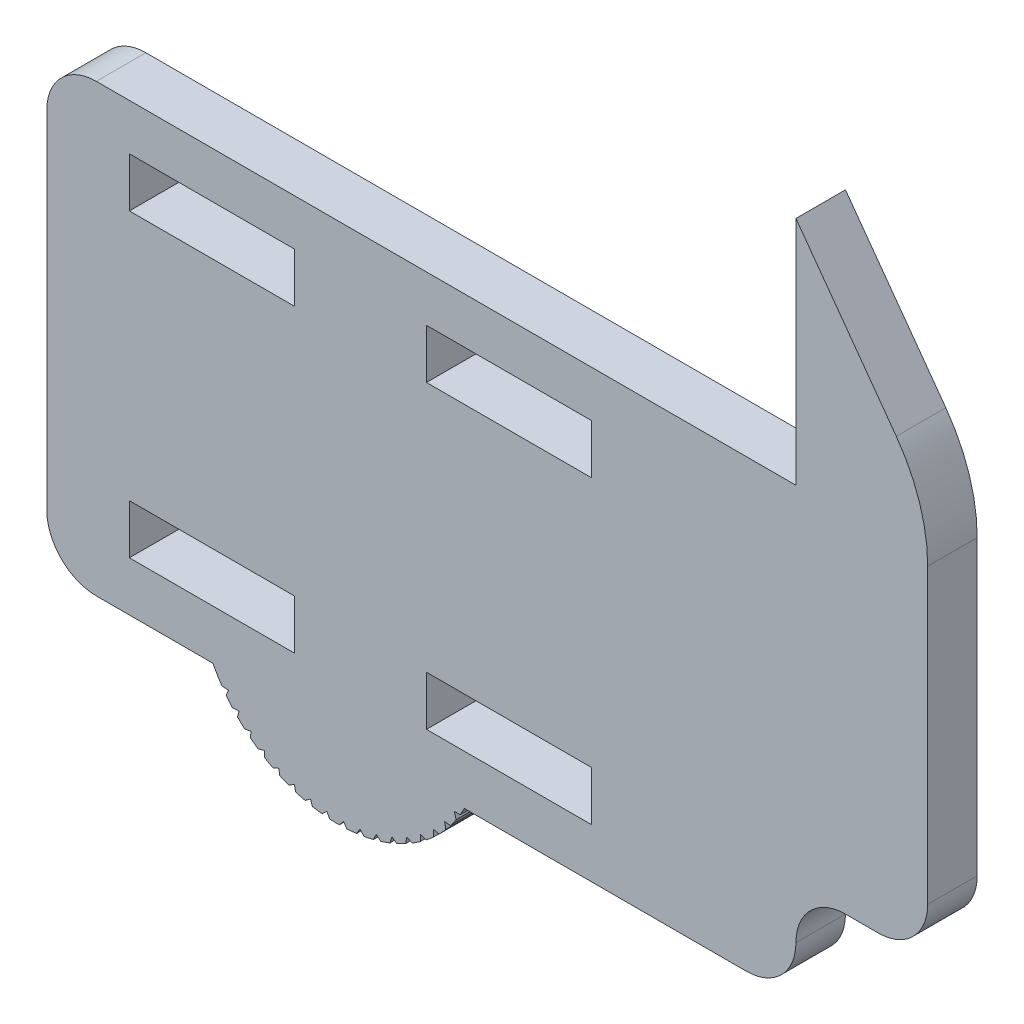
ISO-10303-21;
HEADER;
FILE_DESCRIPTION(('STEP AP214'),'2;1');
FILE_NAME('part.step','',(''),(''),'','','');
FILE_SCHEMA(('AUTOMOTIVE_DESIGN { 1 0 10303 214 1 1 1 1 }'));
ENDSEC;
DATA;
#1=APPLICATION_CONTEXT('core data for automotive mechanical design processes');
#2=APPLICATION_PROTOCOL_DEFINITION('international standard','automotive_design',2000,#1);
#3=PRODUCT_CONTEXT('',#1,'mechanical');
#4=PRODUCT('Part','Part','',(#3));
#5=PRODUCT_RELATED_PRODUCT_CATEGORY('part','',(#4));
#6=PRODUCT_DEFINITION_FORMATION('','',#4);
#7=PRODUCT_DEFINITION_CONTEXT('part definition',#1,'design');
#8=PRODUCT_DEFINITION('design','',#6,#7);
#9=PRODUCT_DEFINITION_SHAPE('','',#8);
#10=(LENGTH_UNIT() NAMED_UNIT(*) SI_UNIT(.MILLI.,.METRE.));
#11=(NAMED_UNIT(*) PLANE_ANGLE_UNIT() SI_UNIT($,.RADIAN.));
#12=(NAMED_UNIT(*) SI_UNIT($,.STERADIAN.) SOLID_ANGLE_UNIT());
#13=UNCERTAINTY_MEASURE_WITH_UNIT(LENGTH_MEASURE(1.E-05),#10,'distance_accuracy_value','');
#14=(GEOMETRIC_REPRESENTATION_CONTEXT(3) GLOBAL_UNCERTAINTY_ASSIGNED_CONTEXT((#13)) GLOBAL_UNIT_ASSIGNED_CONTEXT((#10,
#11,#12)) REPRESENTATION_CONTEXT('',''));
#15=CARTESIAN_POINT('',(0.,0.,0.));
#16=DIRECTION('',(0.,0.,1.));
#17=DIRECTION('',(1.,0.,0.));
#18=AXIS2_PLACEMENT_3D('',#15,#16,#17);
#19=CARTESIAN_POINT('',(0.,-6.,3.));
#20=DIRECTION('',(0.,1.,0.));
#21=DIRECTION('',(-1.,0.,0.));
#22=AXIS2_PLACEMENT_3D('',#19,#20,#21);
#23=PLANE('',#22);
#24=DIRECTION('',(1.,0.,0.));
#25=VECTOR('',#24,1.);
#26=CARTESIAN_POINT('',(0.,-6.,0.));
#27=LINE('',#26,#25);
#28=CARTESIAN_POINT('',(-42.3846510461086,-6.,0.));
#29=VERTEX_POINT('',#28);
#30=CARTESIAN_POINT('',(-35.3219522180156,-6.,0.));
#31=VERTEX_POINT('',#30);
#32=EDGE_CURVE('E1131',#29,#31,#27,.T.);
#33=ORIENTED_EDGE('',*,*,#32,.T.);
#34=DIRECTION('',(0.,0.,1.));
#35=VECTOR('',#34,1.);
#36=CARTESIAN_POINT('',(-35.3219522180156,-6.,0.));
#37=LINE('',#36,#35);
#38=CARTESIAN_POINT('',(-35.3219522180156,-6.,3.));
#39=VERTEX_POINT('',#38);
#40=EDGE_CURVE('E57',#31,#39,#37,.T.);
#41=ORIENTED_EDGE('',*,*,#40,.T.);
#42=DIRECTION('',(1.,0.,0.));
#43=VECTOR('',#42,1.);
#44=CARTESIAN_POINT('',(0.,-6.,3.));
#45=LINE('',#44,#43);
#46=CARTESIAN_POINT('',(-42.3846510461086,-6.,3.));
#47=VERTEX_POINT('',#46);
#48=EDGE_CURVE('E1112',#47,#39,#45,.T.);
#49=ORIENTED_EDGE('',*,*,#48,.F.);
#50=DIRECTION('',(0.,0.,-1.));
#51=VECTOR('',#50,1.);
#52=CARTESIAN_POINT('',(-42.3846510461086,-6.,3.));
#53=LINE('',#52,#51);
#54=EDGE_CURVE('E1181',#47,#29,#53,.T.);
#55=ORIENTED_EDGE('',*,*,#54,.T.);
#56=EDGE_LOOP('',(#33,#41,#49,#55));
#57=FACE_BOUND('',#56,.T.);
#58=ADVANCED_FACE('F33',(#57),#23,.F.);
#59=CARTESIAN_POINT('',(0.,21.,3.));
#60=DIRECTION('',(1.,0.,0.));
#61=DIRECTION('',(0.,0.,-1.));
#62=AXIS2_PLACEMENT_3D('',#59,#60,#61);
#63=PLANE('',#62);
#64=DIRECTION('',(0.,-1.,0.));
#65=VECTOR('',#64,1.);
#66=CARTESIAN_POINT('',(0.,21.,0.));
#67=LINE('',#66,#65);
#68=CARTESIAN_POINT('',(0.,35.,0.));
#69=VERTEX_POINT('',#68);
#70=CARTESIAN_POINT('',(0.,21.,0.));
#71=VERTEX_POINT('',#70);
#72=EDGE_CURVE('E1095',#69,#71,#67,.T.);
#73=ORIENTED_EDGE('',*,*,#72,.T.);
#74=DIRECTION('',(0.,0.,-1.));
#75=VECTOR('',#74,1.);
#76=CARTESIAN_POINT('',(0.,21.,3.));
#77=LINE('',#76,#75);
#78=CARTESIAN_POINT('',(0.,21.,3.));
#79=VERTEX_POINT('',#78);
#80=EDGE_CURVE('E1141',#79,#71,#77,.T.);
#81=ORIENTED_EDGE('',*,*,#80,.F.);
#82=DIRECTION('',(0.,-1.,0.));
#83=VECTOR('',#82,1.);
#84=CARTESIAN_POINT('',(0.,21.,3.));
#85=LINE('',#84,#83);
#86=CARTESIAN_POINT('',(0.,35.,3.));
#87=VERTEX_POINT('',#86);
#88=EDGE_CURVE('E1102',#87,#79,#85,.T.);
#89=ORIENTED_EDGE('',*,*,#88,.F.);
#90=DIRECTION('',(0.,0.,-1.));
#91=VECTOR('',#90,1.);
#92=CARTESIAN_POINT('',(0.,35.,3.));
#93=LINE('',#92,#91);
#94=EDGE_CURVE('E1121',#87,#69,#93,.T.);
#95=ORIENTED_EDGE('',*,*,#94,.T.);
#96=EDGE_LOOP('',(#73,#81,#89,#95));
#97=FACE_BOUND('',#96,.T.);
#98=ADVANCED_FACE('F1423',(#97),#63,.F.);
#99=CARTESIAN_POINT('',(-45.3846510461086,21.,3.));
#100=DIRECTION('',(0.,-1.,0.));
#101=DIRECTION('',(0.,0.,-1.));
#102=AXIS2_PLACEMENT_3D('',#99,#100,#101);
#103=PLANE('',#102);
#104=DIRECTION('',(-1.,0.,0.));
#105=VECTOR('',#104,1.);
#106=CARTESIAN_POINT('',(-45.3846510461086,21.,0.));
#107=LINE('',#106,#105);
#108=CARTESIAN_POINT('',(-42.3846510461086,21.,0.));
#109=VERTEX_POINT('',#108);
#110=EDGE_CURVE('E1124',#71,#109,#107,.T.);
#111=ORIENTED_EDGE('',*,*,#110,.T.);
#112=DIRECTION('',(0.,0.,-1.));
#113=VECTOR('',#112,1.);
#114=CARTESIAN_POINT('',(-42.3846510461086,21.,3.));
#115=LINE('',#114,#113);
#116=CARTESIAN_POINT('',(-42.3846510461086,21.,3.));
#117=VERTEX_POINT('',#116);
#118=EDGE_CURVE('E1169',#109,#117,#115,.F.);
#119=ORIENTED_EDGE('',*,*,#118,.T.);
#120=DIRECTION('',(-1.,0.,0.));
#121=VECTOR('',#120,1.);
#122=CARTESIAN_POINT('',(-45.3846510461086,21.,3.));
#123=LINE('',#122,#121);
#124=EDGE_CURVE('E1105',#79,#117,#123,.T.);
#125=ORIENTED_EDGE('',*,*,#124,.F.);
#126=ORIENTED_EDGE('',*,*,#80,.T.);
#127=EDGE_LOOP('',(#111,#119,#125,#126));
#128=FACE_BOUND('',#127,.T.);
#129=ADVANCED_FACE('F1419',(#128),#103,.F.);
#130=CARTESIAN_POINT('',(-45.3846510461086,-6.,3.));
#131=DIRECTION('',(1.,0.,0.));
#132=DIRECTION('',(0.,0.,-1.));
#133=AXIS2_PLACEMENT_3D('',#130,#131,#132);
#134=PLANE('',#133);
#135=DIRECTION('',(0.,-1.,0.));
#136=VECTOR('',#135,1.);
#137=CARTESIAN_POINT('',(-45.3846510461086,-6.,3.));
#138=LINE('',#137,#136);
#139=CARTESIAN_POINT('',(-45.3846510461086,18.,3.));
#140=VERTEX_POINT('',#139);
#141=CARTESIAN_POINT('',(-45.3846510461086,-3.,3.));
#142=VERTEX_POINT('',#141);
#143=EDGE_CURVE('E1109',#140,#142,#138,.T.);
#144=ORIENTED_EDGE('',*,*,#143,.F.);
#145=DIRECTION('',(0.,0.,-1.));
#146=VECTOR('',#145,1.);
#147=CARTESIAN_POINT('',(-45.3846510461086,18.,3.));
#148=LINE('',#147,#146);
#149=CARTESIAN_POINT('',(-45.3846510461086,18.,0.));
#150=VERTEX_POINT('',#149);
#151=EDGE_CURVE('E1157',#140,#150,#148,.T.);
#152=ORIENTED_EDGE('',*,*,#151,.T.);
#153=DIRECTION('',(0.,-1.,0.));
#154=VECTOR('',#153,1.);
#155=CARTESIAN_POINT('',(-45.3846510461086,-6.,0.));
#156=LINE('',#155,#154);
#157=CARTESIAN_POINT('',(-45.3846510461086,-3.,0.));
#158=VERTEX_POINT('',#157);
#159=EDGE_CURVE('E1127',#150,#158,#156,.T.);
#160=ORIENTED_EDGE('',*,*,#159,.T.);
#161=DIRECTION('',(0.,0.,-1.));
#162=VECTOR('',#161,1.);
#163=CARTESIAN_POINT('',(-45.3846510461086,-3.,3.));
#164=LINE('',#163,#162);
#165=EDGE_CURVE('E1155',#158,#142,#164,.F.);
#166=ORIENTED_EDGE('',*,*,#165,.T.);
#167=EDGE_LOOP('',(#144,#152,#160,#166));
#168=FACE_BOUND('',#167,.T.);
#169=ADVANCED_FACE('F1411',(#168),#134,.F.);
#170=CARTESIAN_POINT('',(-20.0903169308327,-6.,3.));
#171=VERTEX_POINT('',#170);
#172=CARTESIAN_POINT('',(-3.,-6.,3.));
#173=VERTEX_POINT('',#172);
#174=EDGE_CURVE('E49',#171,#173,#45,.T.);
#175=ORIENTED_EDGE('',*,*,#174,.F.);
#176=DIRECTION('',(0.,0.,1.));
#177=VECTOR('',#176,1.);
#178=CARTESIAN_POINT('',(-20.0903169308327,-6.,0.));
#179=LINE('',#178,#177);
#180=CARTESIAN_POINT('',(-20.0903169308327,-6.,0.));
#181=VERTEX_POINT('',#180);
#182=EDGE_CURVE('E872',#181,#171,#179,.T.);
#183=ORIENTED_EDGE('',*,*,#182,.F.);
#184=CARTESIAN_POINT('',(-3.,-6.,0.));
#185=VERTEX_POINT('',#184);
#186=EDGE_CURVE('E1130',#181,#185,#27,.T.);
#187=ORIENTED_EDGE('',*,*,#186,.T.);
#188=DIRECTION('',(0.,0.,-1.));
#189=VECTOR('',#188,1.);
#190=CARTESIAN_POINT('',(-3.,-6.,3.));
#191=LINE('',#190,#189);
#192=EDGE_CURVE('E1179',#185,#173,#191,.F.);
#193=ORIENTED_EDGE('',*,*,#192,.T.);
#194=EDGE_LOOP('',(#175,#183,#187,#193));
#195=FACE_BOUND('',#194,.T.);
#196=ADVANCED_FACE('F1204',(#195),#23,.F.);
#197=CARTESIAN_POINT('',(7.9812626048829,0.,3.));
#198=DIRECTION('',(0.,1.,0.));
#199=DIRECTION('',(0.,0.,1.));
#200=AXIS2_PLACEMENT_3D('',#197,#198,#199);
#201=PLANE('',#200);
#202=DIRECTION('',(1.,0.,0.));
#203=VECTOR('',#202,1.);
#204=CARTESIAN_POINT('',(7.9812626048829,0.,3.));
#205=LINE('',#204,#203);
#206=CARTESIAN_POINT('',(3.,0.,3.));
#207=VERTEX_POINT('',#206);
#208=CARTESIAN_POINT('',(4.9812626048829,0.,3.));
#209=VERTEX_POINT('',#208);
#210=EDGE_CURVE('E1114',#207,#209,#205,.T.);
#211=ORIENTED_EDGE('',*,*,#210,.F.);
#212=DIRECTION('',(0.,0.,-1.));
#213=VECTOR('',#212,1.);
#214=CARTESIAN_POINT('',(3.,0.,0.));
#215=LINE('',#214,#213);
#216=CARTESIAN_POINT('',(3.,0.,0.));
#217=VERTEX_POINT('',#216);
#218=EDGE_CURVE('E1186',#207,#217,#215,.T.);
#219=ORIENTED_EDGE('',*,*,#218,.T.);
#220=DIRECTION('',(1.,0.,0.));
#221=VECTOR('',#220,1.);
#222=CARTESIAN_POINT('',(7.9812626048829,0.,0.));
#223=LINE('',#222,#221);
#224=CARTESIAN_POINT('',(4.9812626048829,0.,0.));
#225=VERTEX_POINT('',#224);
#226=EDGE_CURVE('E1133',#217,#225,#223,.T.);
#227=ORIENTED_EDGE('',*,*,#226,.T.);
#228=DIRECTION('',(0.,0.,-1.));
#229=VECTOR('',#228,1.);
#230=CARTESIAN_POINT('',(4.9812626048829,0.,3.));
#231=LINE('',#230,#229);
#232=EDGE_CURVE('E1184',#225,#209,#231,.F.);
#233=ORIENTED_EDGE('',*,*,#232,.T.);
#234=EDGE_LOOP('',(#211,#219,#227,#233));
#235=FACE_BOUND('',#234,.T.);
#236=ADVANCED_FACE('F1443',(#235),#201,.F.);
#237=CARTESIAN_POINT('',(7.9812626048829,23.9833696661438,3.));
#238=DIRECTION('',(-1.,0.,0.));
#239=DIRECTION('',(0.,0.,1.));
#240=AXIS2_PLACEMENT_3D('',#237,#238,#239);
#241=PLANE('',#240);
#242=DIRECTION('',(0.,1.,0.));
#243=VECTOR('',#242,1.);
#244=CARTESIAN_POINT('',(7.9812626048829,23.9833696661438,3.));
#245=LINE('',#244,#243);
#246=CARTESIAN_POINT('',(7.9812626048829,3.,3.));
#247=VERTEX_POINT('',#246);
#248=CARTESIAN_POINT('',(7.9812626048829,20.741662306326,3.));
#249=VERTEX_POINT('',#248);
#250=EDGE_CURVE('E1117',#247,#249,#245,.T.);
#251=ORIENTED_EDGE('',*,*,#250,.F.);
#252=DIRECTION('',(0.,0.,-1.));
#253=VECTOR('',#252,1.);
#254=CARTESIAN_POINT('',(7.9812626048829,3.,3.));
#255=LINE('',#254,#253);
#256=CARTESIAN_POINT('',(7.9812626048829,3.,0.));
#257=VERTEX_POINT('',#256);
#258=EDGE_CURVE('E1188',#247,#257,#255,.T.);
#259=ORIENTED_EDGE('',*,*,#258,.T.);
#260=DIRECTION('',(0.,1.,0.));
#261=VECTOR('',#260,1.);
#262=CARTESIAN_POINT('',(7.9812626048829,23.9833696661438,0.));
#263=LINE('',#262,#261);
#264=CARTESIAN_POINT('',(7.9812626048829,20.741662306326,0.));
#265=VERTEX_POINT('',#264);
#266=EDGE_CURVE('E1136',#257,#265,#263,.T.);
#267=ORIENTED_EDGE('',*,*,#266,.T.);
#268=DIRECTION('',(0.,0.,-1.));
#269=VECTOR('',#268,1.);
#270=CARTESIAN_POINT('',(7.9812626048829,20.741662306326,3.));
#271=LINE('',#270,#269);
#272=EDGE_CURVE('E1150',#265,#249,#271,.F.);
#273=ORIENTED_EDGE('',*,*,#272,.T.);
#274=EDGE_LOOP('',(#251,#259,#267,#273));
#275=FACE_BOUND('',#274,.T.);
#276=ADVANCED_FACE('F1437',(#275),#241,.F.);
#277=CARTESIAN_POINT('',(0.,35.,3.));
#278=DIRECTION('',(-0.809812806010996,-0.586688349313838,0.));
#279=DIRECTION('',(0.586688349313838,-0.809812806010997,0.));
#280=AXIS2_PLACEMENT_3D('',#277,#278,#279);
#281=PLANE('',#280);
#282=DIRECTION('',(-0.586688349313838,0.809812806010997,0.));
#283=VECTOR('',#282,1.);
#284=CARTESIAN_POINT('',(0.,35.,3.));
#285=LINE('',#284,#283);
#286=CARTESIAN_POINT('',(6.07939066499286,26.6085457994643,3.));
#287=VERTEX_POINT('',#286);
#288=EDGE_CURVE('E1119',#287,#87,#285,.T.);
#289=ORIENTED_EDGE('',*,*,#288,.F.);
#290=DIRECTION('',(0.,0.,-1.));
#291=VECTOR('',#290,1.);
#292=CARTESIAN_POINT('',(6.07939066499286,26.6085457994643,3.));
#293=LINE('',#292,#291);
#294=CARTESIAN_POINT('',(6.07939066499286,26.6085457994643,0.));
#295=VERTEX_POINT('',#294);
#296=EDGE_CURVE('E1144',#287,#295,#293,.T.);
#297=ORIENTED_EDGE('',*,*,#296,.T.);
#298=DIRECTION('',(-0.586688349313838,0.809812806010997,0.));
#299=VECTOR('',#298,1.);
#300=CARTESIAN_POINT('',(0.,35.,0.));
#301=LINE('',#300,#299);
#302=EDGE_CURVE('E1106',#295,#69,#301,.T.);
#303=ORIENTED_EDGE('',*,*,#302,.T.);
#304=ORIENTED_EDGE('',*,*,#94,.F.);
#305=EDGE_LOOP('',(#289,#297,#303,#304));
#306=FACE_BOUND('',#305,.T.);
#307=ADVANCED_FACE('F1430',(#306),#281,.F.);
#308=CARTESIAN_POINT('',(0.,0.,3.));
#309=DIRECTION('',(0.,0.,1.));
#310=DIRECTION('',(1.,0.,0.));
#311=AXIS2_PLACEMENT_3D('',#308,#309,#310);
#312=PLANE('',#311);
#313=DIRECTION('',(0.,-1.,0.));
#314=VECTOR('',#313,1.);
#315=CARTESIAN_POINT('',(-30.3846510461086,0.,3.));
#316=LINE('',#315,#314);
#317=CARTESIAN_POINT('',(-30.3846510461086,0.,3.));
#318=VERTEX_POINT('',#317);
#319=CARTESIAN_POINT('',(-30.3846510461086,-3.,3.));
#320=VERTEX_POINT('',#319);
#321=EDGE_CURVE('E973',#318,#320,#316,.T.);
#322=ORIENTED_EDGE('',*,*,#321,.T.);
#323=DIRECTION('',(-1.,0.,0.));
#324=VECTOR('',#323,1.);
#325=CARTESIAN_POINT('',(-30.3846510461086,-3.,3.));
#326=LINE('',#325,#324);
#327=CARTESIAN_POINT('',(-40.3846510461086,-3.,3.));
#328=VERTEX_POINT('',#327);
#329=EDGE_CURVE('E976',#320,#328,#326,.T.);
#330=ORIENTED_EDGE('',*,*,#329,.T.);
#331=DIRECTION('',(0.,1.,0.));
#332=VECTOR('',#331,1.);
#333=CARTESIAN_POINT('',(-40.3846510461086,0.,3.));
#334=LINE('',#333,#332);
#335=CARTESIAN_POINT('',(-40.3846510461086,0.,3.));
#336=VERTEX_POINT('',#335);
#337=EDGE_CURVE('E980',#328,#336,#334,.T.);
#338=ORIENTED_EDGE('',*,*,#337,.T.);
#339=DIRECTION('',(1.,0.,0.));
#340=VECTOR('',#339,1.);
#341=CARTESIAN_POINT('',(-30.3846510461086,0.,3.));
#342=LINE('',#341,#340);
#343=EDGE_CURVE('E983',#336,#318,#342,.T.);
#344=ORIENTED_EDGE('',*,*,#343,.T.);
#345=EDGE_LOOP('',(#322,#330,#338,#344));
#346=FACE_BOUND('',#345,.T.);
#347=DIRECTION('',(0.,-1.,0.));
#348=VECTOR('',#347,1.);
#349=CARTESIAN_POINT('',(-12.3846510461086,0.,3.));
#350=LINE('',#349,#348);
#351=CARTESIAN_POINT('',(-12.3846510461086,0.,3.));
#352=VERTEX_POINT('',#351);
#353=CARTESIAN_POINT('',(-12.3846510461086,-3.,3.));
#354=VERTEX_POINT('',#353);
#355=EDGE_CURVE('E1006',#352,#354,#350,.T.);
#356=ORIENTED_EDGE('',*,*,#355,.T.);
#357=DIRECTION('',(-1.,0.,0.));
#358=VECTOR('',#357,1.);
#359=CARTESIAN_POINT('',(-12.3846510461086,-3.,3.));
#360=LINE('',#359,#358);
#361=CARTESIAN_POINT('',(-22.3846510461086,-3.,3.));
#362=VERTEX_POINT('',#361);
#363=EDGE_CURVE('E1009',#354,#362,#360,.T.);
#364=ORIENTED_EDGE('',*,*,#363,.T.);
#365=DIRECTION('',(0.,1.,0.));
#366=VECTOR('',#365,1.);
#367=CARTESIAN_POINT('',(-22.3846510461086,0.,3.));
#368=LINE('',#367,#366);
#369=CARTESIAN_POINT('',(-22.3846510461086,0.,3.));
#370=VERTEX_POINT('',#369);
#371=EDGE_CURVE('E1013',#362,#370,#368,.T.);
#372=ORIENTED_EDGE('',*,*,#371,.T.);
#373=DIRECTION('',(1.,0.,0.));
#374=VECTOR('',#373,1.);
#375=CARTESIAN_POINT('',(-12.3846510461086,0.,3.));
#376=LINE('',#375,#374);
#377=EDGE_CURVE('E1016',#370,#352,#376,.T.);
#378=ORIENTED_EDGE('',*,*,#377,.T.);
#379=EDGE_LOOP('',(#356,#364,#372,#378));
#380=FACE_BOUND('',#379,.T.);
#381=DIRECTION('',(0.,-1.,0.));
#382=VECTOR('',#381,1.);
#383=CARTESIAN_POINT('',(-30.3846510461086,18.2,3.));
#384=LINE('',#383,#382);
#385=CARTESIAN_POINT('',(-30.3846510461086,18.2,3.));
#386=VERTEX_POINT('',#385);
#387=CARTESIAN_POINT('',(-30.3846510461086,15.2,3.));
#388=VERTEX_POINT('',#387);
#389=EDGE_CURVE('E1038',#386,#388,#384,.T.);
#390=ORIENTED_EDGE('',*,*,#389,.T.);
#391=DIRECTION('',(-1.,0.,0.));
#392=VECTOR('',#391,1.);
#393=CARTESIAN_POINT('',(-30.3846510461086,15.2,3.));
#394=LINE('',#393,#392);
#395=CARTESIAN_POINT('',(-40.3846510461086,15.2,3.));
#396=VERTEX_POINT('',#395);
#397=EDGE_CURVE('E1041',#388,#396,#394,.T.);
#398=ORIENTED_EDGE('',*,*,#397,.T.);
#399=DIRECTION('',(0.,1.,0.));
#400=VECTOR('',#399,1.);
#401=CARTESIAN_POINT('',(-40.3846510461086,18.2,3.));
#402=LINE('',#401,#400);
#403=CARTESIAN_POINT('',(-40.3846510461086,18.2,3.));
#404=VERTEX_POINT('',#403);
#405=EDGE_CURVE('E1045',#396,#404,#402,.T.);
#406=ORIENTED_EDGE('',*,*,#405,.T.);
#407=DIRECTION('',(1.,0.,0.));
#408=VECTOR('',#407,1.);
#409=CARTESIAN_POINT('',(-30.3846510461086,18.2,3.));
#410=LINE('',#409,#408);
#411=EDGE_CURVE('E1048',#404,#386,#410,.T.);
#412=ORIENTED_EDGE('',*,*,#411,.T.);
#413=EDGE_LOOP('',(#390,#398,#406,#412));
#414=FACE_BOUND('',#413,.T.);
#415=DIRECTION('',(0.,-1.,0.));
#416=VECTOR('',#415,1.);
#417=CARTESIAN_POINT('',(-12.3846510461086,15.2,3.));
#418=LINE('',#417,#416);
#419=CARTESIAN_POINT('',(-12.3846510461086,18.2,3.));
#420=VERTEX_POINT('',#419);
#421=CARTESIAN_POINT('',(-12.3846510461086,15.2,3.));
#422=VERTEX_POINT('',#421);
#423=EDGE_CURVE('E1070',#420,#422,#418,.T.);
#424=ORIENTED_EDGE('',*,*,#423,.T.);
#425=DIRECTION('',(-1.,0.,0.));
#426=VECTOR('',#425,1.);
#427=CARTESIAN_POINT('',(-12.3846510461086,15.2,3.));
#428=LINE('',#427,#426);
#429=CARTESIAN_POINT('',(-22.3846510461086,15.2,3.));
#430=VERTEX_POINT('',#429);
#431=EDGE_CURVE('E1073',#422,#430,#428,.T.);
#432=ORIENTED_EDGE('',*,*,#431,.T.);
#433=DIRECTION('',(0.,1.,0.));
#434=VECTOR('',#433,1.);
#435=CARTESIAN_POINT('',(-22.3846510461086,15.2,3.));
#436=LINE('',#435,#434);
#437=CARTESIAN_POINT('',(-22.3846510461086,18.2,3.));
#438=VERTEX_POINT('',#437);
#439=EDGE_CURVE('E1077',#430,#438,#436,.T.);
#440=ORIENTED_EDGE('',*,*,#439,.T.);
#441=DIRECTION('',(1.,0.,0.));
#442=VECTOR('',#441,1.);
#443=CARTESIAN_POINT('',(-12.3846510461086,18.2,3.));
#444=LINE('',#443,#442);
#445=EDGE_CURVE('E1080',#438,#420,#444,.T.);
#446=ORIENTED_EDGE('',*,*,#445,.T.);
#447=EDGE_LOOP('',(#424,#432,#440,#446));
#448=FACE_BOUND('',#447,.T.);
#449=ORIENTED_EDGE('',*,*,#124,.T.);
#450=CARTESIAN_POINT('',(-42.3846510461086,18.,3.));
#451=DIRECTION('',(0.,0.,1.));
#452=DIRECTION('',(1.,0.,0.));
#453=AXIS2_PLACEMENT_3D('',#450,#451,#452);
#454=CIRCLE('',#453,3.);
#455=EDGE_CURVE('E1177',#117,#140,#454,.T.);
#456=ORIENTED_EDGE('',*,*,#455,.T.);
#457=ORIENTED_EDGE('',*,*,#143,.T.);
#458=CARTESIAN_POINT('',(-42.3846510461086,-3.,3.));
#459=DIRECTION('',(0.,0.,1.));
#460=DIRECTION('',(1.,0.,0.));
#461=AXIS2_PLACEMENT_3D('',#458,#459,#460);
#462=CIRCLE('',#461,3.);
#463=EDGE_CURVE('E1175',#142,#47,#462,.T.);
#464=ORIENTED_EDGE('',*,*,#463,.T.);
#465=ORIENTED_EDGE('',*,*,#48,.T.);
#466=CARTESIAN_POINT('',(-27.7061345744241,-2.08850310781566,3.));
#467=DIRECTION('',(0.,0.,1.));
#468=DIRECTION('',(1.,0.,0.));
#469=AXIS2_PLACEMENT_3D('',#466,#467,#468);
#470=CIRCLE('',#469,8.56157031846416);
#471=CARTESIAN_POINT('',(-34.7786152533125,-6.9134905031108,3.));
#472=VERTEX_POINT('',#471);
#473=EDGE_CURVE('E722',#39,#472,#470,.T.);
#474=ORIENTED_EDGE('',*,*,#473,.T.);
#475=DIRECTION('',(0.996399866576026,-0.0847779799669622,0.));
#476=VECTOR('',#475,1.);
#477=CARTESIAN_POINT('',(-34.7786152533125,-6.9134905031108,3.));
#478=LINE('',#477,#476);
#479=CARTESIAN_POINT('',(-34.3804544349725,-6.94736773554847,3.));
#480=VERTEX_POINT('',#479);
#481=EDGE_CURVE('E549',#472,#480,#478,.T.);
#482=ORIENTED_EDGE('',*,*,#481,.T.);
#483=DIRECTION('',(-0.374606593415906,-0.92718385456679,0.));
#484=VECTOR('',#483,1.);
#485=CARTESIAN_POINT('',(-34.3804544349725,-6.94736773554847,3.));
#486=LINE('',#485,#484);
#487=CARTESIAN_POINT('',(-34.5145995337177,-7.27938850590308,3.));
#488=VERTEX_POINT('',#487);
#489=EDGE_CURVE('E725',#480,#488,#486,.T.);
#490=ORIENTED_EDGE('',*,*,#489,.T.);
#491=CARTESIAN_POINT('',(-27.7061345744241,-2.08850310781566,3.));
#492=DIRECTION('',(0.,0.,1.));
#493=DIRECTION('',(1.,0.,0.));
#494=AXIS2_PLACEMENT_3D('',#491,#492,#493);
#495=CIRCLE('',#494,8.56157031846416);
#496=CARTESIAN_POINT('',(-34.1378800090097,-7.73944435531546,3.));
#497=VERTEX_POINT('',#496);
#498=EDGE_CURVE('E728',#488,#497,#495,.T.);
#499=ORIENTED_EDGE('',*,*,#498,.T.);
#500=DIRECTION('',(0.999304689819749,0.0372845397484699,0.));
#501=VECTOR('',#500,1.);
#502=CARTESIAN_POINT('',(-34.1378800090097,-7.73944435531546,3.));
#503=LINE('',#502,#501);
#504=CARTESIAN_POINT('',(-33.7385584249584,-7.72454547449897,3.));
#505=VERTEX_POINT('',#504);
#506=EDGE_CURVE('E731',#497,#505,#503,.T.);
#507=ORIENTED_EDGE('',*,*,#506,.T.);
#508=DIRECTION('',(-0.258819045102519,-0.965925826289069,0.));
#509=VECTOR('',#508,1.);
#510=CARTESIAN_POINT('',(-33.7385584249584,-7.72454547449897,3.));
#511=LINE('',#510,#509);
#512=CARTESIAN_POINT('',(-33.8312404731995,-8.07043958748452,3.));
#513=VERTEX_POINT('',#512);
#514=EDGE_CURVE('E734',#505,#513,#511,.T.);
#515=ORIENTED_EDGE('',*,*,#514,.T.);
#516=CARTESIAN_POINT('',(-27.7061345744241,-2.08850310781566,3.));
#517=DIRECTION('',(0.,0.,1.));
#518=DIRECTION('',(1.,0.,0.));
#519=AXIS2_PLACEMENT_3D('',#516,#517,#518);
#520=CIRCLE('',#519,8.56157031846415);
#521=CARTESIAN_POINT('',(-33.4012622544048,-8.48115568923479,3.));
#522=VERTEX_POINT('',#521);
#523=EDGE_CURVE('E737',#513,#522,#520,.T.);
#524=ORIENTED_EDGE('',*,*,#523,.T.);
#525=DIRECTION('',(0.98731218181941,0.158791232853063,0.));
#526=VECTOR('',#525,1.);
#527=CARTESIAN_POINT('',(-33.4012622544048,-8.48115568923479,3.));
#528=LINE('',#527,#526);
#529=CARTESIAN_POINT('',(-33.0067328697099,-8.41770280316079,3.));
#530=VERTEX_POINT('',#529);
#531=EDGE_CURVE('E740',#522,#530,#528,.T.);
#532=ORIENTED_EDGE('',*,*,#531,.T.);
#533=DIRECTION('',(-0.139173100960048,-0.990268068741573,0.));
#534=VECTOR('',#533,1.);
#535=CARTESIAN_POINT('',(-33.0067328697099,-8.41770280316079,3.));
#536=LINE('',#535,#534);
#537=CARTESIAN_POINT('',(-33.0565701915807,-8.77231377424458,3.));
#538=VERTEX_POINT('',#537);
#539=EDGE_CURVE('E743',#530,#538,#536,.T.);
#540=ORIENTED_EDGE('',*,*,#539,.T.);
#541=CARTESIAN_POINT('',(-27.7061345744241,-2.08850310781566,3.));
#542=DIRECTION('',(0.,0.,1.));
#543=DIRECTION('',(1.,0.,0.));
#544=AXIS2_PLACEMENT_3D('',#541,#542,#543);
#545=CIRCLE('',#544,8.56157031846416);
#546=CARTESIAN_POINT('',(-32.5797432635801,-9.12756729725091,3.));
#547=VERTEX_POINT('',#546);
#548=EDGE_CURVE('E746',#538,#547,#545,.T.);
#549=ORIENTED_EDGE('',*,*,#548,.T.);
#550=DIRECTION('',(0.960601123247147,0.277930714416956,0.));
#551=VECTOR('',#550,1.);
#552=CARTESIAN_POINT('',(-32.5797432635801,-9.12756729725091,3.));
#553=LINE('',#552,#551);
#554=CARTESIAN_POINT('',(-32.1958876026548,-9.01650634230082,3.));
#555=VERTEX_POINT('',#554);
#556=EDGE_CURVE('E749',#547,#555,#553,.T.);
#557=ORIENTED_EDGE('',*,*,#556,.T.);
#558=DIRECTION('',(-0.0174524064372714,-0.999847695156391,0.));
#559=VECTOR('',#558,1.);
#560=CARTESIAN_POINT('',(-32.1958876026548,-9.01650634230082,3.));
#561=LINE('',#560,#559);
#562=CARTESIAN_POINT('',(-32.2021372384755,-9.37454773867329,3.));
#563=VERTEX_POINT('',#562);
#564=EDGE_CURVE('E752',#555,#563,#561,.T.);
#565=ORIENTED_EDGE('',*,*,#564,.T.);
#566=CARTESIAN_POINT('',(-27.7061345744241,-2.08850310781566,3.));
#567=DIRECTION('',(0.,0.,1.));
#568=DIRECTION('',(1.,0.,0.));
#569=AXIS2_PLACEMENT_3D('',#566,#567,#568);
#570=CIRCLE('',#569,8.56157031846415);
#571=CARTESIAN_POINT('',(-31.6855699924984,-9.66904267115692,3.));
#572=VERTEX_POINT('',#571);
#573=EDGE_CURVE('E755',#563,#572,#570,.T.);
#574=ORIENTED_EDGE('',*,*,#573,.T.);
#575=DIRECTION('',(0.919569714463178,0.39292688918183,0.));
#576=VECTOR('',#575,1.);
#577=CARTESIAN_POINT('',(-31.6855699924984,-9.66904267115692,3.));
#578=LINE('',#577,#576);
#579=CARTESIAN_POINT('',(-31.318110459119,-9.51202931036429,3.));
#580=VERTEX_POINT('',#579);
#581=EDGE_CURVE('E758',#572,#580,#578,.T.);
#582=ORIENTED_EDGE('',*,*,#581,.T.);
#583=DIRECTION('',(0.104528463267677,-0.994521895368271,0.));
#584=VECTOR('',#583,1.);
#585=CARTESIAN_POINT('',(-31.318110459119,-9.51202931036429,3.));
#586=LINE('',#585,#584);
#587=CARTESIAN_POINT('',(-31.2806792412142,-9.86816355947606,3.));
#588=VERTEX_POINT('',#587);
#589=EDGE_CURVE('E761',#580,#588,#586,.T.);
#590=ORIENTED_EDGE('',*,*,#589,.T.);
#591=CARTESIAN_POINT('',(-27.7061345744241,-2.08850310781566,3.));
#592=DIRECTION('',(0.,0.,1.));
#593=DIRECTION('',(1.,0.,0.));
#594=AXIS2_PLACEMENT_3D('',#591,#592,#593);
#595=CIRCLE('',#594,8.56157031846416);
#596=CARTESIAN_POINT('',(-30.7320725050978,-10.0975096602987,3.));
#597=VERTEX_POINT('',#596);
#598=EDGE_CURVE('E764',#588,#597,#595,.T.);
#599=ORIENTED_EDGE('',*,*,#598,.T.);
#600=DIRECTION('',(0.864829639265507,0.502065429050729,0.));
#601=VECTOR('',#600,1.);
#602=CARTESIAN_POINT('',(-30.7320725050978,-10.0975096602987,3.));
#603=LINE('',#602,#601);
#604=CARTESIAN_POINT('',(-30.3864870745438,-9.89688460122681,3.));
#605=VERTEX_POINT('',#604);
#606=EDGE_CURVE('E767',#597,#605,#603,.T.);
#607=ORIENTED_EDGE('',*,*,#606,.T.);
#608=DIRECTION('',(0.224951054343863,-0.974370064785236,0.));
#609=VECTOR('',#608,1.);
#610=CARTESIAN_POINT('',(-30.3864870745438,-9.89688460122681,3.));
#611=LINE('',#610,#609);
#612=CARTESIAN_POINT('',(-30.3059330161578,-10.2458025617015,3.));
#613=VERTEX_POINT('',#612);
#614=EDGE_CURVE('E770',#605,#613,#611,.T.);
#615=ORIENTED_EDGE('',*,*,#614,.T.);
#616=CARTESIAN_POINT('',(-27.7061345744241,-2.08850310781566,3.));
#617=DIRECTION('',(0.,0.,1.));
#618=DIRECTION('',(1.,0.,0.));
#619=AXIS2_PLACEMENT_3D('',#616,#617,#618);
#620=CIRCLE('',#619,8.56157031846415);
#621=CARTESIAN_POINT('',(-29.7334652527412,-10.4065808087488,3.));
#622=VERTEX_POINT('',#621);
#623=EDGE_CURVE('E773',#613,#622,#620,.T.);
#624=ORIENTED_EDGE('',*,*,#623,.T.);
#625=DIRECTION('',(0.797196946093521,0.603719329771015,0.));
#626=VECTOR('',#625,1.);
#627=CARTESIAN_POINT('',(-29.7334652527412,-10.4065808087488,3.));
#628=LINE('',#627,#626);
#629=CARTESIAN_POINT('',(-29.4149058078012,-10.1653349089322,3.));
#630=VERTEX_POINT('',#629);
#631=EDGE_CURVE('E776',#622,#630,#628,.T.);
#632=ORIENTED_EDGE('',*,*,#631,.T.);
#633=DIRECTION('',(0.342020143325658,-0.939692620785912,0.));
#634=VECTOR('',#633,1.);
#635=CARTESIAN_POINT('',(-29.4149058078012,-10.1653349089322,3.));
#636=LINE('',#635,#634);
#637=CARTESIAN_POINT('',(-29.2924297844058,-10.5018350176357,3.));
#638=VERTEX_POINT('',#637);
#639=EDGE_CURVE('E779',#630,#638,#636,.T.);
#640=ORIENTED_EDGE('',*,*,#639,.T.);
#641=CARTESIAN_POINT('',(-27.7061345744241,-2.08850310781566,3.));
#642=DIRECTION('',(0.,0.,1.));
#643=DIRECTION('',(1.,0.,0.));
#644=AXIS2_PLACEMENT_3D('',#641,#642,#643);
#645=CIRCLE('',#644,8.56157031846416);
#646=CARTESIAN_POINT('',(-28.7046351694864,-10.5916485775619,3.));
#647=VERTEX_POINT('',#646);
#648=EDGE_CURVE('E782',#638,#647,#645,.T.);
#649=ORIENTED_EDGE('',*,*,#648,.T.);
#650=DIRECTION('',(0.717679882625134,0.696373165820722,0.));
#651=VECTOR('',#650,1.);
#652=CARTESIAN_POINT('',(-28.7046351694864,-10.5916485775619,3.));
#653=LINE('',#652,#651);
#654=CARTESIAN_POINT('',(-28.417850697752,-10.3133782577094,3.));
#655=VERTEX_POINT('',#654);
#656=EDGE_CURVE('E785',#647,#655,#653,.T.);
#657=ORIENTED_EDGE('',*,*,#656,.T.);
#658=DIRECTION('',(0.453990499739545,-0.891006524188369,0.));
#659=VECTOR('',#658,1.);
#660=CARTESIAN_POINT('',(-28.417850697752,-10.3133782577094,3.));
#661=LINE('',#660,#659);
#662=CARTESIAN_POINT('',(-28.2552785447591,-10.6324440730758,3.));
#663=VERTEX_POINT('',#662);
#664=EDGE_CURVE('E788',#655,#663,#661,.T.);
#665=ORIENTED_EDGE('',*,*,#664,.T.);
#666=CARTESIAN_POINT('',(-27.7061345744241,-2.08850310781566,3.));
#667=DIRECTION('',(0.,0.,1.));
#668=DIRECTION('',(1.,0.,0.));
#669=AXIS2_PLACEMENT_3D('',#666,#667,#668);
#670=CIRCLE('',#669,8.56157031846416);
#671=CARTESIAN_POINT('',(-27.6609197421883,-10.6499540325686,3.));
#672=VERTEX_POINT('',#671);
#673=EDGE_CURVE('E791',#663,#672,#670,.T.);
#674=ORIENTED_EDGE('',*,*,#673,.T.);
#675=DIRECTION('',(0.627463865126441,0.778645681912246,0.));
#676=VECTOR('',#675,1.);
#677=CARTESIAN_POINT('',(-27.6609197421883,-10.6499540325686,3.));
#678=LINE('',#677,#676);
#679=CARTESIAN_POINT('',(-27.4101855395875,-10.3388076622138,3.));
#680=VERTEX_POINT('',#679);
#681=EDGE_CURVE('E794',#672,#680,#678,.T.);
#682=ORIENTED_EDGE('',*,*,#681,.T.);
#683=DIRECTION('',(0.559192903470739,-0.829037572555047,0.));
#684=VECTOR('',#683,1.);
#685=CARTESIAN_POINT('',(-27.4101855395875,-10.3388076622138,3.));
#686=LINE('',#685,#684);
#687=CARTESIAN_POINT('',(-27.2099408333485,-10.6356826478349,3.));
#688=VERTEX_POINT('',#687);
#689=EDGE_CURVE('E797',#680,#688,#686,.T.);
#690=ORIENTED_EDGE('',*,*,#689,.T.);
#691=CARTESIAN_POINT('',(-27.7061345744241,-2.08850310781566,3.));
#692=DIRECTION('',(0.,0.,1.));
#693=DIRECTION('',(1.,0.,0.));
#694=AXIS2_PLACEMENT_3D('',#691,#692,#693);
#695=CIRCLE('',#694,8.56157031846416);
#696=CARTESIAN_POINT('',(-26.6178783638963,-10.5806279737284,3.));
#697=VERTEX_POINT('',#696);
#698=EDGE_CURVE('E800',#688,#697,#695,.T.);
#699=ORIENTED_EDGE('',*,*,#698,.T.);
#700=DIRECTION('',(0.527893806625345,0.849310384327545,0.));
#701=VECTOR('',#700,1.);
#702=CARTESIAN_POINT('',(-26.6178783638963,-10.5806279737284,3.));
#703=LINE('',#702,#701);
#704=CARTESIAN_POINT('',(-26.406932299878,-10.2412440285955,3.));
#705=VERTEX_POINT('',#704);
#706=EDGE_CURVE('E803',#697,#705,#703,.T.);
#707=ORIENTED_EDGE('',*,*,#706,.T.);
#708=DIRECTION('',(0.656059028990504,-0.754709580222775,0.));
#709=VECTOR('',#708,1.);
#710=CARTESIAN_POINT('',(-26.406932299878,-10.2412440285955,3.));
#711=LINE('',#710,#709);
#712=CARTESIAN_POINT('',(-26.172000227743,-10.5115024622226,3.));
#713=VERTEX_POINT('',#712);
#714=EDGE_CURVE('E806',#705,#713,#711,.T.);
#715=ORIENTED_EDGE('',*,*,#714,.T.);
#716=CARTESIAN_POINT('',(-27.7061345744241,-2.08850310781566,3.));
#717=DIRECTION('',(0.,0.,1.));
#718=DIRECTION('',(1.,0.,0.));
#719=AXIS2_PLACEMENT_3D('',#716,#717,#718);
#720=CIRCLE('',#719,8.56157031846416);
#721=CARTESIAN_POINT('',(-25.5910603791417,-10.3847038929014,3.));
#722=VERTEX_POINT('',#721);
#723=EDGE_CURVE('E809',#713,#722,#720,.T.);
#724=ORIENTED_EDGE('',*,*,#723,.T.);
#725=DIRECTION('',(0.420454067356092,0.907313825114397,0.));
#726=VECTOR('',#725,1.);
#727=CARTESIAN_POINT('',(-25.5910603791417,-10.3847038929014,3.));
#728=LINE('',#727,#726);
#729=CARTESIAN_POINT('',(-25.423047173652,-10.022141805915,3.));
#730=VERTEX_POINT('',#729);
#731=EDGE_CURVE('E812',#722,#730,#728,.T.);
#732=ORIENTED_EDGE('',*,*,#731,.T.);
#733=DIRECTION('',(0.7431448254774,-0.669130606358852,0.));
#734=VECTOR('',#733,1.);
#735=CARTESIAN_POINT('',(-25.423047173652,-10.022141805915,3.));
#736=LINE('',#735,#734);
#737=CARTESIAN_POINT('',(-25.1569300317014,-10.2617547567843,3.));
#738=VERTEX_POINT('',#737);
#739=EDGE_CURVE('E815',#730,#738,#736,.T.);
#740=ORIENTED_EDGE('',*,*,#739,.T.);
#741=CARTESIAN_POINT('',(-27.7061345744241,-2.08850310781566,3.));
#742=DIRECTION('',(0.,0.,1.));
#743=DIRECTION('',(1.,0.,0.));
#744=AXIS2_PLACEMENT_3D('',#741,#742,#743);
#745=CIRCLE('',#744,8.56157031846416);
#746=CARTESIAN_POINT('',(-24.595773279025,-10.0651025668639,3.));
#747=VERTEX_POINT('',#746);
#748=EDGE_CURVE('E818',#738,#747,#745,.T.);
#749=ORIENTED_EDGE('',*,*,#748,.T.);
#750=DIRECTION('',(0.306746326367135,0.95179130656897,0.));
#751=VECTOR('',#750,1.);
#752=CARTESIAN_POINT('',(-24.595773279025,-10.0651025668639,3.));
#753=LINE('',#752,#751);
#754=CARTESIAN_POINT('',(-24.4731976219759,-9.68476730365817,3.));
#755=VERTEX_POINT('',#754);
#756=EDGE_CURVE('E821',#747,#755,#753,.T.);
#757=ORIENTED_EDGE('',*,*,#756,.T.);
#758=DIRECTION('',(0.819152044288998,-0.573576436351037,0.));
#759=VECTOR('',#758,1.);
#760=CARTESIAN_POINT('',(-24.4731976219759,-9.68476730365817,3.));
#761=LINE('',#760,#759);
#762=CARTESIAN_POINT('',(-24.1798626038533,-9.89016269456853,3.));
#763=VERTEX_POINT('',#762);
#764=EDGE_CURVE('E824',#755,#763,#761,.T.);
#765=ORIENTED_EDGE('',*,*,#764,.T.);
#766=CARTESIAN_POINT('',(-27.7061345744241,-2.08850310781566,3.));
#767=DIRECTION('',(0.,0.,1.));
#768=DIRECTION('',(1.,0.,0.));
#769=AXIS2_PLACEMENT_3D('',#766,#767,#768);
#770=CIRCLE('',#769,8.56157031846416);
#771=CARTESIAN_POINT('',(-23.6468545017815,-9.62658851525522,3.));
#772=VERTEX_POINT('',#771);
#773=EDGE_CURVE('E827',#763,#772,#770,.T.);
#774=ORIENTED_EDGE('',*,*,#773,.T.);
#775=DIRECTION('',(0.188465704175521,0.982079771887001,0.));
#776=VECTOR('',#775,1.);
#777=CARTESIAN_POINT('',(-23.6468545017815,-9.62658851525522,3.));
#778=LINE('',#777,#776);
#779=CARTESIAN_POINT('',(-23.5715437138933,-9.23414999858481,3.));
#780=VERTEX_POINT('',#779);
#781=EDGE_CURVE('E830',#772,#780,#778,.T.);
#782=ORIENTED_EDGE('',*,*,#781,.T.);
#783=DIRECTION('',(0.882947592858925,-0.469471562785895,0.));
#784=VECTOR('',#783,1.);
#785=CARTESIAN_POINT('',(-23.5715437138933,-9.23414999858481,3.));
#786=LINE('',#785,#784);
#787=CARTESIAN_POINT('',(-23.2553637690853,-9.40226585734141,3.));
#788=VERTEX_POINT('',#787);
#789=EDGE_CURVE('E833',#780,#788,#786,.T.);
#790=ORIENTED_EDGE('',*,*,#789,.T.);
#791=CARTESIAN_POINT('',(-27.7061345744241,-2.08850310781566,3.));
#792=DIRECTION('',(0.,0.,1.));
#793=DIRECTION('',(1.,0.,0.));
#794=AXIS2_PLACEMENT_3D('',#791,#792,#793);
#795=CIRCLE('',#794,8.56157031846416);
#796=CARTESIAN_POINT('',(-22.7584502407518,-9.07569897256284,3.));
#797=VERTEX_POINT('',#796);
#798=EDGE_CURVE('E836',#788,#797,#795,.T.);
#799=ORIENTED_EDGE('',*,*,#798,.T.);
#800=DIRECTION('',(0.0673754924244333,0.997727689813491,0.));
#801=VECTOR('',#800,1.);
#802=CARTESIAN_POINT('',(-22.7584502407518,-9.07569897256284,3.));
#803=LINE('',#802,#801);
#804=CARTESIAN_POINT('',(-22.7315270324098,-8.67700755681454,3.));
#805=VERTEX_POINT('',#804);
#806=EDGE_CURVE('E839',#797,#805,#803,.T.);
#807=ORIENTED_EDGE('',*,*,#806,.T.);
#808=DIRECTION('',(0.933580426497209,-0.358367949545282,0.));
#809=VECTOR('',#808,1.);
#810=CARTESIAN_POINT('',(-22.7315270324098,-8.67700755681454,3.));
#811=LINE('',#810,#809);
#812=CARTESIAN_POINT('',(-22.3972156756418,-8.80533766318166,3.));
#813=VERTEX_POINT('',#812);
#814=EDGE_CURVE('E842',#805,#813,#811,.T.);
#815=ORIENTED_EDGE('',*,*,#814,.T.);
#816=CARTESIAN_POINT('',(-27.7061345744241,-2.08850310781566,3.));
#817=DIRECTION('',(0.,0.,1.));
#818=DIRECTION('',(1.,0.,0.));
#819=AXIS2_PLACEMENT_3D('',#816,#817,#818);
#820=CIRCLE('',#819,8.56157031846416);
#821=CARTESIAN_POINT('',(-21.9438045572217,-8.42064643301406,3.));
#822=VERTEX_POINT('',#821);
#823=EDGE_CURVE('E845',#813,#822,#820,.T.);
#824=ORIENTED_EDGE('',*,*,#823,.T.);
#825=DIRECTION('',(-0.0547191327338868,0.998501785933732,0.));
#826=VECTOR('',#825,1.);
#827=CARTESIAN_POINT('',(-21.9438045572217,-8.42064643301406,3.));
#828=LINE('',#827,#826);
#829=CARTESIAN_POINT('',(-21.9656702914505,-8.02164568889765,3.));
#830=VERTEX_POINT('',#829);
#831=EDGE_CURVE('E848',#822,#830,#828,.T.);
#832=ORIENTED_EDGE('',*,*,#831,.T.);
#833=DIRECTION('',(0.970295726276,-0.241921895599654,0.));
#834=VECTOR('',#833,1.);
#835=CARTESIAN_POINT('',(-21.9656702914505,-8.02164568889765,3.));
#836=LINE('',#835,#834);
#837=CARTESIAN_POINT('',(-21.6182113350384,-8.10827693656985,3.));
#838=VERTEX_POINT('',#837);
#839=EDGE_CURVE('E851',#830,#838,#836,.T.);
#840=ORIENTED_EDGE('',*,*,#839,.T.);
#841=CARTESIAN_POINT('',(-27.7061345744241,-2.08850310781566,3.));
#842=DIRECTION('',(0.,0.,1.));
#843=DIRECTION('',(1.,0.,0.));
#844=AXIS2_PLACEMENT_3D('',#841,#842,#843);
#845=CIRCLE('',#844,8.56157031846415);
#846=CARTESIAN_POINT('',(-21.2150619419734,-7.67119622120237,3.));
#847=VERTEX_POINT('',#846);
#848=EDGE_CURVE('E854',#838,#847,#845,.T.);
#849=ORIENTED_EDGE('',*,*,#848,.T.);
#850=DIRECTION('',(-0.175998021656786,0.984390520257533,0.));
#851=VECTOR('',#850,1.);
#852=CARTESIAN_POINT('',(-21.2150619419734,-7.67119622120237,3.));
#853=LINE('',#852,#851);
#854=CARTESIAN_POINT('',(-21.2853906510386,-7.27783433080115,3.));
#855=VERTEX_POINT('',#854);
#856=EDGE_CURVE('E857',#847,#855,#853,.T.);
#857=ORIENTED_EDGE('',*,*,#856,.T.);
#858=DIRECTION('',(0.992546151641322,-0.121869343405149,0.));
#859=VECTOR('',#858,1.);
#860=CARTESIAN_POINT('',(-21.2853906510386,-7.27783433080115,3.));
#861=LINE('',#860,#859);
#862=CARTESIAN_POINT('',(-20.9299639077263,-7.32147524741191,3.));
#863=VERTEX_POINT('',#862);
#864=EDGE_CURVE('E860',#855,#863,#861,.T.);
#865=ORIENTED_EDGE('',*,*,#864,.T.);
#866=CARTESIAN_POINT('',(-27.7061345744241,-2.08850310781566,3.));
#867=DIRECTION('',(0.,0.,1.));
#868=DIRECTION('',(1.,0.,0.));
#869=AXIS2_PLACEMENT_3D('',#866,#867,#868);
#870=CIRCLE('',#869,8.56157031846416);
#871=CARTESIAN_POINT('',(-20.5830862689,-6.83852091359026,3.));
#872=VERTEX_POINT('',#871);
#873=EDGE_CURVE('E863',#863,#872,#870,.T.);
#874=ORIENTED_EDGE('',*,*,#873,.T.);
#875=DIRECTION('',(-0.294653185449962,0.955604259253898,0.));
#876=VECTOR('',#875,1.);
#877=CARTESIAN_POINT('',(-20.5830862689,-6.83852091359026,3.));
#878=LINE('',#877,#876);
#879=CARTESIAN_POINT('',(-20.7008295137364,-6.45666199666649,3.));
#880=VERTEX_POINT('',#879);
#881=EDGE_CURVE('E866',#872,#880,#878,.T.);
#882=ORIENTED_EDGE('',*,*,#881,.T.);
#883=DIRECTION('',(1.,0.,0.));
#884=VECTOR('',#883,1.);
#885=CARTESIAN_POINT('',(-20.7008295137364,-6.45666199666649,3.));
#886=LINE('',#885,#884);
#887=CARTESIAN_POINT('',(-20.3427335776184,-6.45666199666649,3.));
#888=VERTEX_POINT('',#887);
#889=EDGE_CURVE('E572',#880,#888,#886,.T.);
#890=ORIENTED_EDGE('',*,*,#889,.T.);
#891=CARTESIAN_POINT('',(-27.7061345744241,-2.08850310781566,3.));
#892=DIRECTION('',(0.,0.,1.));
#893=DIRECTION('',(1.,0.,0.));
#894=AXIS2_PLACEMENT_3D('',#891,#892,#893);
#895=CIRCLE('',#894,8.56157031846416);
#896=EDGE_CURVE('E569',#888,#171,#895,.T.);
#897=ORIENTED_EDGE('',*,*,#896,.T.);
#898=ORIENTED_EDGE('',*,*,#174,.T.);
#899=CARTESIAN_POINT('',(-3.,-3.,3.));
#900=DIRECTION('',(0.,0.,1.));
#901=DIRECTION('',(1.,0.,0.));
#902=AXIS2_PLACEMENT_3D('',#899,#900,#901);
#903=CIRCLE('',#902,3.);
#904=CARTESIAN_POINT('',(0.,-3.,3.));
#905=VERTEX_POINT('',#904);
#906=EDGE_CURVE('E1173',#173,#905,#903,.T.);
#907=ORIENTED_EDGE('',*,*,#906,.T.);
#908=CARTESIAN_POINT('',(3.,-3.,3.));
#909=DIRECTION('',(0.,0.,1.));
#910=DIRECTION('',(1.,0.,0.));
#911=AXIS2_PLACEMENT_3D('',#908,#909,#910);
#912=CIRCLE('',#911,3.);
#913=EDGE_CURVE('E11',#905,#207,#912,.F.);
#914=ORIENTED_EDGE('',*,*,#913,.T.);
#915=ORIENTED_EDGE('',*,*,#210,.T.);
#916=CARTESIAN_POINT('',(4.9812626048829,3.,3.));
#917=DIRECTION('',(0.,0.,1.));
#918=DIRECTION('',(1.,0.,0.));
#919=AXIS2_PLACEMENT_3D('',#916,#917,#918);
#920=CIRCLE('',#919,3.);
#921=EDGE_CURVE('E1171',#209,#247,#920,.T.);
#922=ORIENTED_EDGE('',*,*,#921,.T.);
#923=ORIENTED_EDGE('',*,*,#250,.T.);
#924=CARTESIAN_POINT('',(-2.0187373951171,20.741662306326,3.));
#925=DIRECTION('',(0.,0.,1.));
#926=DIRECTION('',(1.,0.,0.));
#927=AXIS2_PLACEMENT_3D('',#924,#925,#926);
#928=CIRCLE('',#927,10.);
#929=EDGE_CURVE('E1153',#249,#287,#928,.T.);
#930=ORIENTED_EDGE('',*,*,#929,.T.);
#931=ORIENTED_EDGE('',*,*,#288,.T.);
#932=ORIENTED_EDGE('',*,*,#88,.T.);
#933=EDGE_LOOP('',(#449,#456,#457,#464,#465,#474,#482,#490,#499,#507,#515,#524,#532,#540,#549,
#557,#565,#574,#582,#590,#599,#607,#615,#624,#632,#640,#649,#657,#665,#674,#682,#690,#699,#707,
#715,#724,#732,#740,#749,#757,#765,#774,#782,#790,#799,#807,#815,#824,#832,#840,#849,#857,#865,
#874,#882,#890,#897,#898,#907,#914,#915,#922,#923,#930,#931,#932));
#934=FACE_BOUND('',#933,.T.);
#935=ADVANCED_FACE('F1403',(#346,#380,#414,#448,#934),#312,.T.);
#936=CARTESIAN_POINT('',(0.,0.,0.));
#937=DIRECTION('',(0.,0.,1.));
#938=DIRECTION('',(1.,0.,0.));
#939=AXIS2_PLACEMENT_3D('',#936,#937,#938);
#940=PLANE('',#939);
#941=DIRECTION('',(-1.,0.,0.));
#942=VECTOR('',#941,1.);
#943=CARTESIAN_POINT('',(-30.3846510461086,-3.,0.));
#944=LINE('',#943,#942);
#945=CARTESIAN_POINT('',(-30.3846510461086,-3.,0.));
#946=VERTEX_POINT('',#945);
#947=CARTESIAN_POINT('',(-40.3846510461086,-3.,0.));
#948=VERTEX_POINT('',#947);
#949=EDGE_CURVE('E989',#946,#948,#944,.T.);
#950=ORIENTED_EDGE('',*,*,#949,.F.);
#951=DIRECTION('',(0.,-1.,0.));
#952=VECTOR('',#951,1.);
#953=CARTESIAN_POINT('',(-30.3846510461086,0.,0.));
#954=LINE('',#953,#952);
#955=CARTESIAN_POINT('',(-30.3846510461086,0.,0.));
#956=VERTEX_POINT('',#955);
#957=EDGE_CURVE('E987',#956,#946,#954,.T.);
#958=ORIENTED_EDGE('',*,*,#957,.F.);
#959=DIRECTION('',(1.,0.,0.));
#960=VECTOR('',#959,1.);
#961=CARTESIAN_POINT('',(-30.3846510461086,0.,0.));
#962=LINE('',#961,#960);
#963=CARTESIAN_POINT('',(-40.3846510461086,0.,0.));
#964=VERTEX_POINT('',#963);
#965=EDGE_CURVE('E977',#964,#956,#962,.T.);
#966=ORIENTED_EDGE('',*,*,#965,.F.);
#967=DIRECTION('',(0.,1.,0.));
#968=VECTOR('',#967,1.);
#969=CARTESIAN_POINT('',(-40.3846510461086,0.,0.));
#970=LINE('',#969,#968);
#971=EDGE_CURVE('E992',#948,#964,#970,.T.);
#972=ORIENTED_EDGE('',*,*,#971,.F.);
#973=EDGE_LOOP('',(#950,#958,#966,#972));
#974=FACE_BOUND('',#973,.T.);
#975=DIRECTION('',(-1.,0.,0.));
#976=VECTOR('',#975,1.);
#977=CARTESIAN_POINT('',(-12.3846510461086,-3.,0.));
#978=LINE('',#977,#976);
#979=CARTESIAN_POINT('',(-12.3846510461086,-3.,0.));
#980=VERTEX_POINT('',#979);
#981=CARTESIAN_POINT('',(-22.3846510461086,-3.,0.));
#982=VERTEX_POINT('',#981);
#983=EDGE_CURVE('E1021',#980,#982,#978,.T.);
#984=ORIENTED_EDGE('',*,*,#983,.F.);
#985=DIRECTION('',(0.,-1.,0.));
#986=VECTOR('',#985,1.);
#987=CARTESIAN_POINT('',(-12.3846510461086,0.,0.));
#988=LINE('',#987,#986);
#989=CARTESIAN_POINT('',(-12.3846510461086,0.,0.));
#990=VERTEX_POINT('',#989);
#991=EDGE_CURVE('E999',#990,#980,#988,.T.);
#992=ORIENTED_EDGE('',*,*,#991,.F.);
#993=DIRECTION('',(1.,0.,0.));
#994=VECTOR('',#993,1.);
#995=CARTESIAN_POINT('',(-12.3846510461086,0.,0.));
#996=LINE('',#995,#994);
#997=CARTESIAN_POINT('',(-22.3846510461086,0.,0.));
#998=VERTEX_POINT('',#997);
#999=EDGE_CURVE('E1010',#998,#990,#996,.T.);
#1000=ORIENTED_EDGE('',*,*,#999,.F.);
#1001=DIRECTION('',(0.,1.,0.));
#1002=VECTOR('',#1001,1.);
#1003=CARTESIAN_POINT('',(-22.3846510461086,0.,0.));
#1004=LINE('',#1003,#1002);
#1005=EDGE_CURVE('E1024',#982,#998,#1004,.T.);
#1006=ORIENTED_EDGE('',*,*,#1005,.F.);
#1007=EDGE_LOOP('',(#984,#992,#1000,#1006));
#1008=FACE_BOUND('',#1007,.T.);
#1009=DIRECTION('',(-1.,0.,0.));
#1010=VECTOR('',#1009,1.);
#1011=CARTESIAN_POINT('',(-30.3846510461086,15.2,0.));
#1012=LINE('',#1011,#1010);
#1013=CARTESIAN_POINT('',(-30.3846510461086,15.2,0.));
#1014=VERTEX_POINT('',#1013);
#1015=CARTESIAN_POINT('',(-40.3846510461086,15.2,0.));
#1016=VERTEX_POINT('',#1015);
#1017=EDGE_CURVE('E1053',#1014,#1016,#1012,.T.);
#1018=ORIENTED_EDGE('',*,*,#1017,.F.);
#1019=DIRECTION('',(0.,-1.,0.));
#1020=VECTOR('',#1019,1.);
#1021=CARTESIAN_POINT('',(-30.3846510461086,18.2,0.));
#1022=LINE('',#1021,#1020);
#1023=CARTESIAN_POINT('',(-30.3846510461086,18.2,0.));
#1024=VERTEX_POINT('',#1023);
#1025=EDGE_CURVE('E1031',#1024,#1014,#1022,.T.);
#1026=ORIENTED_EDGE('',*,*,#1025,.F.);
#1027=DIRECTION('',(1.,0.,0.));
#1028=VECTOR('',#1027,1.);
#1029=CARTESIAN_POINT('',(-30.3846510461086,18.2,0.));
#1030=LINE('',#1029,#1028);
#1031=CARTESIAN_POINT('',(-40.3846510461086,18.2,0.));
#1032=VERTEX_POINT('',#1031);
#1033=EDGE_CURVE('E1042',#1032,#1024,#1030,.T.);
#1034=ORIENTED_EDGE('',*,*,#1033,.F.);
#1035=DIRECTION('',(0.,1.,0.));
#1036=VECTOR('',#1035,1.);
#1037=CARTESIAN_POINT('',(-40.3846510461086,18.2,0.));
#1038=LINE('',#1037,#1036);
#1039=EDGE_CURVE('E1056',#1016,#1032,#1038,.T.);
#1040=ORIENTED_EDGE('',*,*,#1039,.F.);
#1041=EDGE_LOOP('',(#1018,#1026,#1034,#1040));
#1042=FACE_BOUND('',#1041,.T.);
#1043=DIRECTION('',(-1.,0.,0.));
#1044=VECTOR('',#1043,1.);
#1045=CARTESIAN_POINT('',(-12.3846510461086,15.2,0.));
#1046=LINE('',#1045,#1044);
#1047=CARTESIAN_POINT('',(-12.3846510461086,15.2,0.));
#1048=VERTEX_POINT('',#1047);
#1049=CARTESIAN_POINT('',(-22.3846510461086,15.2,0.));
#1050=VERTEX_POINT('',#1049);
#1051=EDGE_CURVE('E1085',#1048,#1050,#1046,.T.);
#1052=ORIENTED_EDGE('',*,*,#1051,.F.);
#1053=DIRECTION('',(0.,-1.,0.));
#1054=VECTOR('',#1053,1.);
#1055=CARTESIAN_POINT('',(-12.3846510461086,15.2,0.));
#1056=LINE('',#1055,#1054);
#1057=CARTESIAN_POINT('',(-12.3846510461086,18.2,0.));
#1058=VERTEX_POINT('',#1057);
#1059=EDGE_CURVE('E1063',#1058,#1048,#1056,.T.);
#1060=ORIENTED_EDGE('',*,*,#1059,.F.);
#1061=DIRECTION('',(1.,0.,0.));
#1062=VECTOR('',#1061,1.);
#1063=CARTESIAN_POINT('',(-12.3846510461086,18.2,0.));
#1064=LINE('',#1063,#1062);
#1065=CARTESIAN_POINT('',(-22.3846510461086,18.2,0.));
#1066=VERTEX_POINT('',#1065);
#1067=EDGE_CURVE('E1074',#1066,#1058,#1064,.T.);
#1068=ORIENTED_EDGE('',*,*,#1067,.F.);
#1069=DIRECTION('',(0.,1.,0.));
#1070=VECTOR('',#1069,1.);
#1071=CARTESIAN_POINT('',(-22.3846510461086,15.2,0.));
#1072=LINE('',#1071,#1070);
#1073=EDGE_CURVE('E1088',#1050,#1066,#1072,.T.);
#1074=ORIENTED_EDGE('',*,*,#1073,.F.);
#1075=EDGE_LOOP('',(#1052,#1060,#1068,#1074));
#1076=FACE_BOUND('',#1075,.T.);
#1077=ORIENTED_EDGE('',*,*,#159,.F.);
#1078=CARTESIAN_POINT('',(-42.3846510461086,18.,0.));
#1079=DIRECTION('',(0.,0.,1.));
#1080=DIRECTION('',(1.,0.,0.));
#1081=AXIS2_PLACEMENT_3D('',#1078,#1079,#1080);
#1082=CIRCLE('',#1081,3.);
#1083=EDGE_CURVE('E1167',#150,#109,#1082,.F.);
#1084=ORIENTED_EDGE('',*,*,#1083,.T.);
#1085=ORIENTED_EDGE('',*,*,#110,.F.);
#1086=ORIENTED_EDGE('',*,*,#72,.F.);
#1087=ORIENTED_EDGE('',*,*,#302,.F.);
#1088=CARTESIAN_POINT('',(-2.0187373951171,20.741662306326,0.));
#1089=DIRECTION('',(0.,0.,1.));
#1090=DIRECTION('',(1.,0.,0.));
#1091=AXIS2_PLACEMENT_3D('',#1088,#1089,#1090);
#1092=CIRCLE('',#1091,10.);
#1093=EDGE_CURVE('E1147',#295,#265,#1092,.F.);
#1094=ORIENTED_EDGE('',*,*,#1093,.T.);
#1095=ORIENTED_EDGE('',*,*,#266,.F.);
#1096=CARTESIAN_POINT('',(4.9812626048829,3.,0.));
#1097=DIRECTION('',(0.,0.,1.));
#1098=DIRECTION('',(1.,0.,0.));
#1099=AXIS2_PLACEMENT_3D('',#1096,#1097,#1098);
#1100=CIRCLE('',#1099,3.);
#1101=EDGE_CURVE('E1160',#257,#225,#1100,.F.);
#1102=ORIENTED_EDGE('',*,*,#1101,.T.);
#1103=ORIENTED_EDGE('',*,*,#226,.F.);
#1104=CARTESIAN_POINT('',(3.,-3.,0.));
#1105=DIRECTION('',(0.,0.,1.));
#1106=DIRECTION('',(1.,0.,0.));
#1107=AXIS2_PLACEMENT_3D('',#1104,#1105,#1106);
#1108=CIRCLE('',#1107,3.);
#1109=CARTESIAN_POINT('',(0.,-3.,0.));
#1110=VERTEX_POINT('',#1109);
#1111=EDGE_CURVE('E42',#217,#1110,#1108,.T.);
#1112=ORIENTED_EDGE('',*,*,#1111,.T.);
#1113=CARTESIAN_POINT('',(-3.,-3.,0.));
#1114=DIRECTION('',(0.,0.,1.));
#1115=DIRECTION('',(1.,0.,0.));
#1116=AXIS2_PLACEMENT_3D('',#1113,#1114,#1115);
#1117=CIRCLE('',#1116,3.);
#1118=EDGE_CURVE('E1162',#1110,#185,#1117,.F.);
#1119=ORIENTED_EDGE('',*,*,#1118,.T.);
#1120=ORIENTED_EDGE('',*,*,#186,.F.);
#1121=CARTESIAN_POINT('',(-27.7061345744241,-2.08850310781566,0.));
#1122=DIRECTION('',(0.,0.,1.));
#1123=DIRECTION('',(1.,0.,0.));
#1124=AXIS2_PLACEMENT_3D('',#1121,#1122,#1123);
#1125=CIRCLE('',#1124,8.56157031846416);
#1126=CARTESIAN_POINT('',(-20.3427335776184,-6.45666199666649,0.));
#1127=VERTEX_POINT('',#1126);
#1128=EDGE_CURVE('E555',#1127,#181,#1125,.T.);
#1129=ORIENTED_EDGE('',*,*,#1128,.F.);
#1130=DIRECTION('',(1.,0.,0.));
#1131=VECTOR('',#1130,1.);
#1132=CARTESIAN_POINT('',(-20.7008295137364,-6.45666199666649,0.));
#1133=LINE('',#1132,#1131);
#1134=CARTESIAN_POINT('',(-20.7008295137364,-6.45666199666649,0.));
#1135=VERTEX_POINT('',#1134);
#1136=EDGE_CURVE('E717',#1135,#1127,#1133,.T.);
#1137=ORIENTED_EDGE('',*,*,#1136,.F.);
#1138=DIRECTION('',(-0.294653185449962,0.955604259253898,0.));
#1139=VECTOR('',#1138,1.);
#1140=CARTESIAN_POINT('',(-20.5830862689,-6.83852091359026,0.));
#1141=LINE('',#1140,#1139);
#1142=CARTESIAN_POINT('',(-20.5830862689,-6.83852091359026,0.));
#1143=VERTEX_POINT('',#1142);
#1144=EDGE_CURVE('E714',#1143,#1135,#1141,.T.);
#1145=ORIENTED_EDGE('',*,*,#1144,.F.);
#1146=CARTESIAN_POINT('',(-27.7061345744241,-2.08850310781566,0.));
#1147=DIRECTION('',(0.,0.,1.));
#1148=DIRECTION('',(1.,0.,0.));
#1149=AXIS2_PLACEMENT_3D('',#1146,#1147,#1148);
#1150=CIRCLE('',#1149,8.56157031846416);
#1151=CARTESIAN_POINT('',(-20.9299639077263,-7.32147524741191,0.));
#1152=VERTEX_POINT('',#1151);
#1153=EDGE_CURVE('E711',#1152,#1143,#1150,.T.);
#1154=ORIENTED_EDGE('',*,*,#1153,.F.);
#1155=DIRECTION('',(0.992546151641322,-0.121869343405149,0.));
#1156=VECTOR('',#1155,1.);
#1157=CARTESIAN_POINT('',(-21.2853906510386,-7.27783433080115,0.));
#1158=LINE('',#1157,#1156);
#1159=CARTESIAN_POINT('',(-21.2853906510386,-7.27783433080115,0.));
#1160=VERTEX_POINT('',#1159);
#1161=EDGE_CURVE('E708',#1160,#1152,#1158,.T.);
#1162=ORIENTED_EDGE('',*,*,#1161,.F.);
#1163=DIRECTION('',(-0.175998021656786,0.984390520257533,0.));
#1164=VECTOR('',#1163,1.);
#1165=CARTESIAN_POINT('',(-21.2150619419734,-7.67119622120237,0.));
#1166=LINE('',#1165,#1164);
#1167=CARTESIAN_POINT('',(-21.2150619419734,-7.67119622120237,0.));
#1168=VERTEX_POINT('',#1167);
#1169=EDGE_CURVE('E705',#1168,#1160,#1166,.T.);
#1170=ORIENTED_EDGE('',*,*,#1169,.F.);
#1171=CARTESIAN_POINT('',(-27.7061345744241,-2.08850310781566,0.));
#1172=DIRECTION('',(0.,0.,1.));
#1173=DIRECTION('',(1.,0.,0.));
#1174=AXIS2_PLACEMENT_3D('',#1171,#1172,#1173);
#1175=CIRCLE('',#1174,8.56157031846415);
#1176=CARTESIAN_POINT('',(-21.6182113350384,-8.10827693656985,0.));
#1177=VERTEX_POINT('',#1176);
#1178=EDGE_CURVE('E702',#1177,#1168,#1175,.T.);
#1179=ORIENTED_EDGE('',*,*,#1178,.F.);
#1180=DIRECTION('',(0.970295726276,-0.241921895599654,0.));
#1181=VECTOR('',#1180,1.);
#1182=CARTESIAN_POINT('',(-21.9656702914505,-8.02164568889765,0.));
#1183=LINE('',#1182,#1181);
#1184=CARTESIAN_POINT('',(-21.9656702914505,-8.02164568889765,0.));
#1185=VERTEX_POINT('',#1184);
#1186=EDGE_CURVE('E699',#1185,#1177,#1183,.T.);
#1187=ORIENTED_EDGE('',*,*,#1186,.F.);
#1188=DIRECTION('',(-0.0547191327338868,0.998501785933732,0.));
#1189=VECTOR('',#1188,1.);
#1190=CARTESIAN_POINT('',(-21.9438045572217,-8.42064643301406,0.));
#1191=LINE('',#1190,#1189);
#1192=CARTESIAN_POINT('',(-21.9438045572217,-8.42064643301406,0.));
#1193=VERTEX_POINT('',#1192);
#1194=EDGE_CURVE('E696',#1193,#1185,#1191,.T.);
#1195=ORIENTED_EDGE('',*,*,#1194,.F.);
#1196=CARTESIAN_POINT('',(-27.7061345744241,-2.08850310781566,0.));
#1197=DIRECTION('',(0.,0.,1.));
#1198=DIRECTION('',(1.,0.,0.));
#1199=AXIS2_PLACEMENT_3D('',#1196,#1197,#1198);
#1200=CIRCLE('',#1199,8.56157031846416);
#1201=CARTESIAN_POINT('',(-22.3972156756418,-8.80533766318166,0.));
#1202=VERTEX_POINT('',#1201);
#1203=EDGE_CURVE('E693',#1202,#1193,#1200,.T.);
#1204=ORIENTED_EDGE('',*,*,#1203,.F.);
#1205=DIRECTION('',(0.933580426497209,-0.358367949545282,0.));
#1206=VECTOR('',#1205,1.);
#1207=CARTESIAN_POINT('',(-22.7315270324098,-8.67700755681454,0.));
#1208=LINE('',#1207,#1206);
#1209=CARTESIAN_POINT('',(-22.7315270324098,-8.67700755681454,0.));
#1210=VERTEX_POINT('',#1209);
#1211=EDGE_CURVE('E690',#1210,#1202,#1208,.T.);
#1212=ORIENTED_EDGE('',*,*,#1211,.F.);
#1213=DIRECTION('',(0.0673754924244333,0.997727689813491,0.));
#1214=VECTOR('',#1213,1.);
#1215=CARTESIAN_POINT('',(-22.7584502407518,-9.07569897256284,0.));
#1216=LINE('',#1215,#1214);
#1217=CARTESIAN_POINT('',(-22.7584502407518,-9.07569897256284,0.));
#1218=VERTEX_POINT('',#1217);
#1219=EDGE_CURVE('E687',#1218,#1210,#1216,.T.);
#1220=ORIENTED_EDGE('',*,*,#1219,.F.);
#1221=CARTESIAN_POINT('',(-27.7061345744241,-2.08850310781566,0.));
#1222=DIRECTION('',(0.,0.,1.));
#1223=DIRECTION('',(1.,0.,0.));
#1224=AXIS2_PLACEMENT_3D('',#1221,#1222,#1223);
#1225=CIRCLE('',#1224,8.56157031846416);
#1226=CARTESIAN_POINT('',(-23.2553637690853,-9.40226585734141,0.));
#1227=VERTEX_POINT('',#1226);
#1228=EDGE_CURVE('E684',#1227,#1218,#1225,.T.);
#1229=ORIENTED_EDGE('',*,*,#1228,.F.);
#1230=DIRECTION('',(0.882947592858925,-0.469471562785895,0.));
#1231=VECTOR('',#1230,1.);
#1232=CARTESIAN_POINT('',(-23.5715437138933,-9.23414999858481,0.));
#1233=LINE('',#1232,#1231);
#1234=CARTESIAN_POINT('',(-23.5715437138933,-9.23414999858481,0.));
#1235=VERTEX_POINT('',#1234);
#1236=EDGE_CURVE('E681',#1235,#1227,#1233,.T.);
#1237=ORIENTED_EDGE('',*,*,#1236,.F.);
#1238=DIRECTION('',(0.188465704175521,0.982079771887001,0.));
#1239=VECTOR('',#1238,1.);
#1240=CARTESIAN_POINT('',(-23.6468545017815,-9.62658851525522,0.));
#1241=LINE('',#1240,#1239);
#1242=CARTESIAN_POINT('',(-23.6468545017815,-9.62658851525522,0.));
#1243=VERTEX_POINT('',#1242);
#1244=EDGE_CURVE('E678',#1243,#1235,#1241,.T.);
#1245=ORIENTED_EDGE('',*,*,#1244,.F.);
#1246=CARTESIAN_POINT('',(-27.7061345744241,-2.08850310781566,0.));
#1247=DIRECTION('',(0.,0.,1.));
#1248=DIRECTION('',(1.,0.,0.));
#1249=AXIS2_PLACEMENT_3D('',#1246,#1247,#1248);
#1250=CIRCLE('',#1249,8.56157031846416);
#1251=CARTESIAN_POINT('',(-24.1798626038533,-9.89016269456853,0.));
#1252=VERTEX_POINT('',#1251);
#1253=EDGE_CURVE('E675',#1252,#1243,#1250,.T.);
#1254=ORIENTED_EDGE('',*,*,#1253,.F.);
#1255=DIRECTION('',(0.819152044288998,-0.573576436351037,0.));
#1256=VECTOR('',#1255,1.);
#1257=CARTESIAN_POINT('',(-24.4731976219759,-9.68476730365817,0.));
#1258=LINE('',#1257,#1256);
#1259=CARTESIAN_POINT('',(-24.4731976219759,-9.68476730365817,0.));
#1260=VERTEX_POINT('',#1259);
#1261=EDGE_CURVE('E672',#1260,#1252,#1258,.T.);
#1262=ORIENTED_EDGE('',*,*,#1261,.F.);
#1263=DIRECTION('',(0.306746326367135,0.95179130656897,0.));
#1264=VECTOR('',#1263,1.);
#1265=CARTESIAN_POINT('',(-24.595773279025,-10.0651025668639,0.));
#1266=LINE('',#1265,#1264);
#1267=CARTESIAN_POINT('',(-24.595773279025,-10.0651025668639,0.));
#1268=VERTEX_POINT('',#1267);
#1269=EDGE_CURVE('E669',#1268,#1260,#1266,.T.);
#1270=ORIENTED_EDGE('',*,*,#1269,.F.);
#1271=CARTESIAN_POINT('',(-27.7061345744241,-2.08850310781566,0.));
#1272=DIRECTION('',(0.,0.,1.));
#1273=DIRECTION('',(1.,0.,0.));
#1274=AXIS2_PLACEMENT_3D('',#1271,#1272,#1273);
#1275=CIRCLE('',#1274,8.56157031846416);
#1276=CARTESIAN_POINT('',(-25.1569300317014,-10.2617547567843,0.));
#1277=VERTEX_POINT('',#1276);
#1278=EDGE_CURVE('E666',#1277,#1268,#1275,.T.);
#1279=ORIENTED_EDGE('',*,*,#1278,.F.);
#1280=DIRECTION('',(0.7431448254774,-0.669130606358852,0.));
#1281=VECTOR('',#1280,1.);
#1282=CARTESIAN_POINT('',(-25.423047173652,-10.022141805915,0.));
#1283=LINE('',#1282,#1281);
#1284=CARTESIAN_POINT('',(-25.423047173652,-10.022141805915,0.));
#1285=VERTEX_POINT('',#1284);
#1286=EDGE_CURVE('E663',#1285,#1277,#1283,.T.);
#1287=ORIENTED_EDGE('',*,*,#1286,.F.);
#1288=DIRECTION('',(0.420454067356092,0.907313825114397,0.));
#1289=VECTOR('',#1288,1.);
#1290=CARTESIAN_POINT('',(-25.5910603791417,-10.3847038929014,0.));
#1291=LINE('',#1290,#1289);
#1292=CARTESIAN_POINT('',(-25.5910603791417,-10.3847038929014,0.));
#1293=VERTEX_POINT('',#1292);
#1294=EDGE_CURVE('E660',#1293,#1285,#1291,.T.);
#1295=ORIENTED_EDGE('',*,*,#1294,.F.);
#1296=CARTESIAN_POINT('',(-27.7061345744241,-2.08850310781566,0.));
#1297=DIRECTION('',(0.,0.,1.));
#1298=DIRECTION('',(1.,0.,0.));
#1299=AXIS2_PLACEMENT_3D('',#1296,#1297,#1298);
#1300=CIRCLE('',#1299,8.56157031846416);
#1301=CARTESIAN_POINT('',(-26.172000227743,-10.5115024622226,0.));
#1302=VERTEX_POINT('',#1301);
#1303=EDGE_CURVE('E657',#1302,#1293,#1300,.T.);
#1304=ORIENTED_EDGE('',*,*,#1303,.F.);
#1305=DIRECTION('',(0.656059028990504,-0.754709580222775,0.));
#1306=VECTOR('',#1305,1.);
#1307=CARTESIAN_POINT('',(-26.406932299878,-10.2412440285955,0.));
#1308=LINE('',#1307,#1306);
#1309=CARTESIAN_POINT('',(-26.406932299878,-10.2412440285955,0.));
#1310=VERTEX_POINT('',#1309);
#1311=EDGE_CURVE('E654',#1310,#1302,#1308,.T.);
#1312=ORIENTED_EDGE('',*,*,#1311,.F.);
#1313=DIRECTION('',(0.527893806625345,0.849310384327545,0.));
#1314=VECTOR('',#1313,1.);
#1315=CARTESIAN_POINT('',(-26.6178783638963,-10.5806279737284,0.));
#1316=LINE('',#1315,#1314);
#1317=CARTESIAN_POINT('',(-26.6178783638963,-10.5806279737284,0.));
#1318=VERTEX_POINT('',#1317);
#1319=EDGE_CURVE('E651',#1318,#1310,#1316,.T.);
#1320=ORIENTED_EDGE('',*,*,#1319,.F.);
#1321=CARTESIAN_POINT('',(-27.7061345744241,-2.08850310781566,0.));
#1322=DIRECTION('',(0.,0.,1.));
#1323=DIRECTION('',(1.,0.,0.));
#1324=AXIS2_PLACEMENT_3D('',#1321,#1322,#1323);
#1325=CIRCLE('',#1324,8.56157031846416);
#1326=CARTESIAN_POINT('',(-27.2099408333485,-10.6356826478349,0.));
#1327=VERTEX_POINT('',#1326);
#1328=EDGE_CURVE('E648',#1327,#1318,#1325,.T.);
#1329=ORIENTED_EDGE('',*,*,#1328,.F.);
#1330=DIRECTION('',(0.559192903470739,-0.829037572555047,0.));
#1331=VECTOR('',#1330,1.);
#1332=CARTESIAN_POINT('',(-27.4101855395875,-10.3388076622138,0.));
#1333=LINE('',#1332,#1331);
#1334=CARTESIAN_POINT('',(-27.4101855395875,-10.3388076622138,0.));
#1335=VERTEX_POINT('',#1334);
#1336=EDGE_CURVE('E645',#1335,#1327,#1333,.T.);
#1337=ORIENTED_EDGE('',*,*,#1336,.F.);
#1338=DIRECTION('',(0.627463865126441,0.778645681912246,0.));
#1339=VECTOR('',#1338,1.);
#1340=CARTESIAN_POINT('',(-27.6609197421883,-10.6499540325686,0.));
#1341=LINE('',#1340,#1339);
#1342=CARTESIAN_POINT('',(-27.6609197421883,-10.6499540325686,0.));
#1343=VERTEX_POINT('',#1342);
#1344=EDGE_CURVE('E642',#1343,#1335,#1341,.T.);
#1345=ORIENTED_EDGE('',*,*,#1344,.F.);
#1346=CARTESIAN_POINT('',(-27.7061345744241,-2.08850310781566,0.));
#1347=DIRECTION('',(0.,0.,1.));
#1348=DIRECTION('',(1.,0.,0.));
#1349=AXIS2_PLACEMENT_3D('',#1346,#1347,#1348);
#1350=CIRCLE('',#1349,8.56157031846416);
#1351=CARTESIAN_POINT('',(-28.2552785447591,-10.6324440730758,0.));
#1352=VERTEX_POINT('',#1351);
#1353=EDGE_CURVE('E639',#1352,#1343,#1350,.T.);
#1354=ORIENTED_EDGE('',*,*,#1353,.F.);
#1355=DIRECTION('',(0.453990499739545,-0.891006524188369,0.));
#1356=VECTOR('',#1355,1.);
#1357=CARTESIAN_POINT('',(-28.417850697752,-10.3133782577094,0.));
#1358=LINE('',#1357,#1356);
#1359=CARTESIAN_POINT('',(-28.417850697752,-10.3133782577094,0.));
#1360=VERTEX_POINT('',#1359);
#1361=EDGE_CURVE('E636',#1360,#1352,#1358,.T.);
#1362=ORIENTED_EDGE('',*,*,#1361,.F.);
#1363=DIRECTION('',(0.717679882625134,0.696373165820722,0.));
#1364=VECTOR('',#1363,1.);
#1365=CARTESIAN_POINT('',(-28.7046351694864,-10.5916485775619,0.));
#1366=LINE('',#1365,#1364);
#1367=CARTESIAN_POINT('',(-28.7046351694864,-10.5916485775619,0.));
#1368=VERTEX_POINT('',#1367);
#1369=EDGE_CURVE('E633',#1368,#1360,#1366,.T.);
#1370=ORIENTED_EDGE('',*,*,#1369,.F.);
#1371=CARTESIAN_POINT('',(-27.7061345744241,-2.08850310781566,0.));
#1372=DIRECTION('',(0.,0.,1.));
#1373=DIRECTION('',(1.,0.,0.));
#1374=AXIS2_PLACEMENT_3D('',#1371,#1372,#1373);
#1375=CIRCLE('',#1374,8.56157031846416);
#1376=CARTESIAN_POINT('',(-29.2924297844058,-10.5018350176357,0.));
#1377=VERTEX_POINT('',#1376);
#1378=EDGE_CURVE('E630',#1377,#1368,#1375,.T.);
#1379=ORIENTED_EDGE('',*,*,#1378,.F.);
#1380=DIRECTION('',(0.342020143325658,-0.939692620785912,0.));
#1381=VECTOR('',#1380,1.);
#1382=CARTESIAN_POINT('',(-29.4149058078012,-10.1653349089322,0.));
#1383=LINE('',#1382,#1381);
#1384=CARTESIAN_POINT('',(-29.4149058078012,-10.1653349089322,0.));
#1385=VERTEX_POINT('',#1384);
#1386=EDGE_CURVE('E627',#1385,#1377,#1383,.T.);
#1387=ORIENTED_EDGE('',*,*,#1386,.F.);
#1388=DIRECTION('',(0.797196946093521,0.603719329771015,0.));
#1389=VECTOR('',#1388,1.);
#1390=CARTESIAN_POINT('',(-29.7334652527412,-10.4065808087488,0.));
#1391=LINE('',#1390,#1389);
#1392=CARTESIAN_POINT('',(-29.7334652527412,-10.4065808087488,0.));
#1393=VERTEX_POINT('',#1392);
#1394=EDGE_CURVE('E624',#1393,#1385,#1391,.T.);
#1395=ORIENTED_EDGE('',*,*,#1394,.F.);
#1396=CARTESIAN_POINT('',(-27.7061345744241,-2.08850310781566,0.));
#1397=DIRECTION('',(0.,0.,1.));
#1398=DIRECTION('',(1.,0.,0.));
#1399=AXIS2_PLACEMENT_3D('',#1396,#1397,#1398);
#1400=CIRCLE('',#1399,8.56157031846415);
#1401=CARTESIAN_POINT('',(-30.3059330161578,-10.2458025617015,0.));
#1402=VERTEX_POINT('',#1401);
#1403=EDGE_CURVE('E621',#1402,#1393,#1400,.T.);
#1404=ORIENTED_EDGE('',*,*,#1403,.F.);
#1405=DIRECTION('',(0.224951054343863,-0.974370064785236,0.));
#1406=VECTOR('',#1405,1.);
#1407=CARTESIAN_POINT('',(-30.3864870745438,-9.89688460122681,0.));
#1408=LINE('',#1407,#1406);
#1409=CARTESIAN_POINT('',(-30.3864870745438,-9.89688460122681,0.));
#1410=VERTEX_POINT('',#1409);
#1411=EDGE_CURVE('E618',#1410,#1402,#1408,.T.);
#1412=ORIENTED_EDGE('',*,*,#1411,.F.);
#1413=DIRECTION('',(0.864829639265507,0.502065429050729,0.));
#1414=VECTOR('',#1413,1.);
#1415=CARTESIAN_POINT('',(-30.7320725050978,-10.0975096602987,0.));
#1416=LINE('',#1415,#1414);
#1417=CARTESIAN_POINT('',(-30.7320725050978,-10.0975096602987,0.));
#1418=VERTEX_POINT('',#1417);
#1419=EDGE_CURVE('E615',#1418,#1410,#1416,.T.);
#1420=ORIENTED_EDGE('',*,*,#1419,.F.);
#1421=CARTESIAN_POINT('',(-27.7061345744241,-2.08850310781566,0.));
#1422=DIRECTION('',(0.,0.,1.));
#1423=DIRECTION('',(1.,0.,0.));
#1424=AXIS2_PLACEMENT_3D('',#1421,#1422,#1423);
#1425=CIRCLE('',#1424,8.56157031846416);
#1426=CARTESIAN_POINT('',(-31.2806792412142,-9.86816355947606,0.));
#1427=VERTEX_POINT('',#1426);
#1428=EDGE_CURVE('E612',#1427,#1418,#1425,.T.);
#1429=ORIENTED_EDGE('',*,*,#1428,.F.);
#1430=DIRECTION('',(0.104528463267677,-0.994521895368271,0.));
#1431=VECTOR('',#1430,1.);
#1432=CARTESIAN_POINT('',(-31.318110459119,-9.51202931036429,0.));
#1433=LINE('',#1432,#1431);
#1434=CARTESIAN_POINT('',(-31.318110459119,-9.51202931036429,0.));
#1435=VERTEX_POINT('',#1434);
#1436=EDGE_CURVE('E609',#1435,#1427,#1433,.T.);
#1437=ORIENTED_EDGE('',*,*,#1436,.F.);
#1438=DIRECTION('',(0.919569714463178,0.39292688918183,0.));
#1439=VECTOR('',#1438,1.);
#1440=CARTESIAN_POINT('',(-31.6855699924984,-9.66904267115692,0.));
#1441=LINE('',#1440,#1439);
#1442=CARTESIAN_POINT('',(-31.6855699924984,-9.66904267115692,0.));
#1443=VERTEX_POINT('',#1442);
#1444=EDGE_CURVE('E606',#1443,#1435,#1441,.T.);
#1445=ORIENTED_EDGE('',*,*,#1444,.F.);
#1446=CARTESIAN_POINT('',(-27.7061345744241,-2.08850310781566,0.));
#1447=DIRECTION('',(0.,0.,1.));
#1448=DIRECTION('',(1.,0.,0.));
#1449=AXIS2_PLACEMENT_3D('',#1446,#1447,#1448);
#1450=CIRCLE('',#1449,8.56157031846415);
#1451=CARTESIAN_POINT('',(-32.2021372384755,-9.37454773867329,0.));
#1452=VERTEX_POINT('',#1451);
#1453=EDGE_CURVE('E603',#1452,#1443,#1450,.T.);
#1454=ORIENTED_EDGE('',*,*,#1453,.F.);
#1455=DIRECTION('',(-0.0174524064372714,-0.999847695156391,0.));
#1456=VECTOR('',#1455,1.);
#1457=CARTESIAN_POINT('',(-32.1958876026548,-9.01650634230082,0.));
#1458=LINE('',#1457,#1456);
#1459=CARTESIAN_POINT('',(-32.1958876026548,-9.01650634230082,0.));
#1460=VERTEX_POINT('',#1459);
#1461=EDGE_CURVE('E600',#1460,#1452,#1458,.T.);
#1462=ORIENTED_EDGE('',*,*,#1461,.F.);
#1463=DIRECTION('',(0.960601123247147,0.277930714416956,0.));
#1464=VECTOR('',#1463,1.);
#1465=CARTESIAN_POINT('',(-32.5797432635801,-9.12756729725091,0.));
#1466=LINE('',#1465,#1464);
#1467=CARTESIAN_POINT('',(-32.5797432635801,-9.12756729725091,0.));
#1468=VERTEX_POINT('',#1467);
#1469=EDGE_CURVE('E597',#1468,#1460,#1466,.T.);
#1470=ORIENTED_EDGE('',*,*,#1469,.F.);
#1471=CARTESIAN_POINT('',(-27.7061345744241,-2.08850310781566,0.));
#1472=DIRECTION('',(0.,0.,1.));
#1473=DIRECTION('',(1.,0.,0.));
#1474=AXIS2_PLACEMENT_3D('',#1471,#1472,#1473);
#1475=CIRCLE('',#1474,8.56157031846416);
#1476=CARTESIAN_POINT('',(-33.0565701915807,-8.77231377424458,0.));
#1477=VERTEX_POINT('',#1476);
#1478=EDGE_CURVE('E594',#1477,#1468,#1475,.T.);
#1479=ORIENTED_EDGE('',*,*,#1478,.F.);
#1480=DIRECTION('',(-0.139173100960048,-0.990268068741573,0.));
#1481=VECTOR('',#1480,1.);
#1482=CARTESIAN_POINT('',(-33.0067328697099,-8.41770280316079,0.));
#1483=LINE('',#1482,#1481);
#1484=CARTESIAN_POINT('',(-33.0067328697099,-8.41770280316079,0.));
#1485=VERTEX_POINT('',#1484);
#1486=EDGE_CURVE('E591',#1485,#1477,#1483,.T.);
#1487=ORIENTED_EDGE('',*,*,#1486,.F.);
#1488=DIRECTION('',(0.98731218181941,0.158791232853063,0.));
#1489=VECTOR('',#1488,1.);
#1490=CARTESIAN_POINT('',(-33.4012622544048,-8.48115568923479,0.));
#1491=LINE('',#1490,#1489);
#1492=CARTESIAN_POINT('',(-33.4012622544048,-8.48115568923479,0.));
#1493=VERTEX_POINT('',#1492);
#1494=EDGE_CURVE('E588',#1493,#1485,#1491,.T.);
#1495=ORIENTED_EDGE('',*,*,#1494,.F.);
#1496=CARTESIAN_POINT('',(-27.7061345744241,-2.08850310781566,0.));
#1497=DIRECTION('',(0.,0.,1.));
#1498=DIRECTION('',(1.,0.,0.));
#1499=AXIS2_PLACEMENT_3D('',#1496,#1497,#1498);
#1500=CIRCLE('',#1499,8.56157031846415);
#1501=CARTESIAN_POINT('',(-33.8312404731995,-8.07043958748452,0.));
#1502=VERTEX_POINT('',#1501);
#1503=EDGE_CURVE('E585',#1502,#1493,#1500,.T.);
#1504=ORIENTED_EDGE('',*,*,#1503,.F.);
#1505=DIRECTION('',(-0.258819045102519,-0.965925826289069,0.));
#1506=VECTOR('',#1505,1.);
#1507=CARTESIAN_POINT('',(-33.7385584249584,-7.72454547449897,0.));
#1508=LINE('',#1507,#1506);
#1509=CARTESIAN_POINT('',(-33.7385584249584,-7.72454547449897,0.));
#1510=VERTEX_POINT('',#1509);
#1511=EDGE_CURVE('E582',#1510,#1502,#1508,.T.);
#1512=ORIENTED_EDGE('',*,*,#1511,.F.);
#1513=DIRECTION('',(0.999304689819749,0.0372845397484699,0.));
#1514=VECTOR('',#1513,1.);
#1515=CARTESIAN_POINT('',(-34.1378800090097,-7.73944435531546,0.));
#1516=LINE('',#1515,#1514);
#1517=CARTESIAN_POINT('',(-34.1378800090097,-7.73944435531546,0.));
#1518=VERTEX_POINT('',#1517);
#1519=EDGE_CURVE('E579',#1518,#1510,#1516,.T.);
#1520=ORIENTED_EDGE('',*,*,#1519,.F.);
#1521=CARTESIAN_POINT('',(-27.7061345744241,-2.08850310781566,0.));
#1522=DIRECTION('',(0.,0.,1.));
#1523=DIRECTION('',(1.,0.,0.));
#1524=AXIS2_PLACEMENT_3D('',#1521,#1522,#1523);
#1525=CIRCLE('',#1524,8.56157031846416);
#1526=CARTESIAN_POINT('',(-34.5145995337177,-7.27938850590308,0.));
#1527=VERTEX_POINT('',#1526);
#1528=EDGE_CURVE('E576',#1527,#1518,#1525,.T.);
#1529=ORIENTED_EDGE('',*,*,#1528,.F.);
#1530=DIRECTION('',(-0.374606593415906,-0.92718385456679,0.));
#1531=VECTOR('',#1530,1.);
#1532=CARTESIAN_POINT('',(-34.3804544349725,-6.94736773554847,0.));
#1533=LINE('',#1532,#1531);
#1534=CARTESIAN_POINT('',(-34.3804544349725,-6.94736773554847,0.));
#1535=VERTEX_POINT('',#1534);
#1536=EDGE_CURVE('E566',#1535,#1527,#1533,.T.);
#1537=ORIENTED_EDGE('',*,*,#1536,.F.);
#1538=DIRECTION('',(0.996399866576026,-0.0847779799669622,0.));
#1539=VECTOR('',#1538,1.);
#1540=CARTESIAN_POINT('',(-34.7786152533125,-6.9134905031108,0.));
#1541=LINE('',#1540,#1539);
#1542=CARTESIAN_POINT('',(-34.7786152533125,-6.9134905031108,0.));
#1543=VERTEX_POINT('',#1542);
#1544=EDGE_CURVE('E547',#1543,#1535,#1541,.T.);
#1545=ORIENTED_EDGE('',*,*,#1544,.F.);
#1546=CARTESIAN_POINT('',(-27.7061345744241,-2.08850310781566,0.));
#1547=DIRECTION('',(0.,0.,1.));
#1548=DIRECTION('',(1.,0.,0.));
#1549=AXIS2_PLACEMENT_3D('',#1546,#1547,#1548);
#1550=CIRCLE('',#1549,8.56157031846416);
#1551=EDGE_CURVE('E563',#31,#1543,#1550,.T.);
#1552=ORIENTED_EDGE('',*,*,#1551,.F.);
#1553=ORIENTED_EDGE('',*,*,#32,.F.);
#1554=CARTESIAN_POINT('',(-42.3846510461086,-3.,0.));
#1555=DIRECTION('',(0.,0.,1.));
#1556=DIRECTION('',(1.,0.,0.));
#1557=AXIS2_PLACEMENT_3D('',#1554,#1555,#1556);
#1558=CIRCLE('',#1557,3.);
#1559=EDGE_CURVE('E1165',#29,#158,#1558,.F.);
#1560=ORIENTED_EDGE('',*,*,#1559,.T.);
#1561=EDGE_LOOP('',(#1077,#1084,#1085,#1086,#1087,#1094,#1095,#1102,#1103,#1112,#1119,#1120,
#1129,#1137,#1145,#1154,#1162,#1170,#1179,#1187,#1195,#1204,#1212,#1220,#1229,#1237,#1245,#1254,
#1262,#1270,#1279,#1287,#1295,#1304,#1312,#1320,#1329,#1337,#1345,#1354,#1362,#1370,#1379,#1387,
#1395,#1404,#1412,#1420,#1429,#1437,#1445,#1454,#1462,#1470,#1479,#1487,#1495,#1504,#1512,#1520,
#1529,#1537,#1545,#1552,#1553,#1560));
#1562=FACE_BOUND('',#1561,.T.);
#1563=ADVANCED_FACE('F561',(#974,#1008,#1042,#1076,#1562),#940,.F.);
#1564=CARTESIAN_POINT('',(-12.3846510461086,15.2,3.));
#1565=DIRECTION('',(1.,0.,0.));
#1566=DIRECTION('',(0.,0.,-1.));
#1567=AXIS2_PLACEMENT_3D('',#1564,#1565,#1566);
#1568=PLANE('',#1567);
#1569=ORIENTED_EDGE('',*,*,#1059,.T.);
#1570=DIRECTION('',(0.,0.,-1.));
#1571=VECTOR('',#1570,1.);
#1572=CARTESIAN_POINT('',(-12.3846510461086,15.2,3.));
#1573=LINE('',#1572,#1571);
#1574=EDGE_CURVE('E1083',#422,#1048,#1573,.T.);
#1575=ORIENTED_EDGE('',*,*,#1574,.F.);
#1576=ORIENTED_EDGE('',*,*,#423,.F.);
#1577=DIRECTION('',(0.,0.,-1.));
#1578=VECTOR('',#1577,1.);
#1579=CARTESIAN_POINT('',(-12.3846510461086,18.2,3.));
#1580=LINE('',#1579,#1578);
#1581=EDGE_CURVE('E1093',#420,#1058,#1580,.T.);
#1582=ORIENTED_EDGE('',*,*,#1581,.T.);
#1583=EDGE_LOOP('',(#1569,#1575,#1576,#1582));
#1584=FACE_BOUND('',#1583,.T.);
#1585=ADVANCED_FACE('F1962',(#1584),#1568,.F.);
#1586=CARTESIAN_POINT('',(-12.3846510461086,18.2,3.));
#1587=DIRECTION('',(0.,1.,0.));
#1588=DIRECTION('',(0.,0.,1.));
#1589=AXIS2_PLACEMENT_3D('',#1586,#1587,#1588);
#1590=PLANE('',#1589);
#1591=ORIENTED_EDGE('',*,*,#1067,.T.);
#1592=ORIENTED_EDGE('',*,*,#1581,.F.);
#1593=ORIENTED_EDGE('',*,*,#445,.F.);
#1594=DIRECTION('',(0.,0.,-1.));
#1595=VECTOR('',#1594,1.);
#1596=CARTESIAN_POINT('',(-22.3846510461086,18.2,3.));
#1597=LINE('',#1596,#1595);
#1598=EDGE_CURVE('E1096',#438,#1066,#1597,.T.);
#1599=ORIENTED_EDGE('',*,*,#1598,.T.);
#1600=EDGE_LOOP('',(#1591,#1592,#1593,#1599));
#1601=FACE_BOUND('',#1600,.T.);
#1602=ADVANCED_FACE('F1958',(#1601),#1590,.F.);
#1603=CARTESIAN_POINT('',(-22.3846510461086,15.2,3.));
#1604=DIRECTION('',(-1.,0.,0.));
#1605=DIRECTION('',(0.,0.,1.));
#1606=AXIS2_PLACEMENT_3D('',#1603,#1604,#1605);
#1607=PLANE('',#1606);
#1608=ORIENTED_EDGE('',*,*,#1073,.T.);
#1609=ORIENTED_EDGE('',*,*,#1598,.F.);
#1610=ORIENTED_EDGE('',*,*,#439,.F.);
#1611=DIRECTION('',(0.,0.,-1.));
#1612=VECTOR('',#1611,1.);
#1613=CARTESIAN_POINT('',(-22.3846510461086,15.2,3.));
#1614=LINE('',#1613,#1612);
#1615=EDGE_CURVE('E1098',#430,#1050,#1614,.T.);
#1616=ORIENTED_EDGE('',*,*,#1615,.T.);
#1617=EDGE_LOOP('',(#1608,#1609,#1610,#1616));
#1618=FACE_BOUND('',#1617,.T.);
#1619=ADVANCED_FACE('F1961',(#1618),#1607,.F.);
#1620=CARTESIAN_POINT('',(-12.3846510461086,15.2,3.));
#1621=DIRECTION('',(0.,-1.,0.));
#1622=DIRECTION('',(0.,0.,-1.));
#1623=AXIS2_PLACEMENT_3D('',#1620,#1621,#1622);
#1624=PLANE('',#1623);
#1625=ORIENTED_EDGE('',*,*,#1051,.T.);
#1626=ORIENTED_EDGE('',*,*,#1615,.F.);
#1627=ORIENTED_EDGE('',*,*,#431,.F.);
#1628=ORIENTED_EDGE('',*,*,#1574,.T.);
#1629=EDGE_LOOP('',(#1625,#1626,#1627,#1628));
#1630=FACE_BOUND('',#1629,.T.);
#1631=ADVANCED_FACE('F1956',(#1630),#1624,.F.);
#1632=CARTESIAN_POINT('',(-30.3846510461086,18.2,3.));
#1633=DIRECTION('',(1.,0.,0.));
#1634=DIRECTION('',(0.,0.,-1.));
#1635=AXIS2_PLACEMENT_3D('',#1632,#1633,#1634);
#1636=PLANE('',#1635);
#1637=ORIENTED_EDGE('',*,*,#1025,.T.);
#1638=DIRECTION('',(0.,0.,-1.));
#1639=VECTOR('',#1638,1.);
#1640=CARTESIAN_POINT('',(-30.3846510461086,15.2,3.));
#1641=LINE('',#1640,#1639);
#1642=EDGE_CURVE('E1051',#388,#1014,#1641,.T.);
#1643=ORIENTED_EDGE('',*,*,#1642,.F.);
#1644=ORIENTED_EDGE('',*,*,#389,.F.);
#1645=DIRECTION('',(0.,0.,-1.));
#1646=VECTOR('',#1645,1.);
#1647=CARTESIAN_POINT('',(-30.3846510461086,18.2,3.));
#1648=LINE('',#1647,#1646);
#1649=EDGE_CURVE('E1061',#386,#1024,#1648,.T.);
#1650=ORIENTED_EDGE('',*,*,#1649,.T.);
#1651=EDGE_LOOP('',(#1637,#1643,#1644,#1650));
#1652=FACE_BOUND('',#1651,.T.);
#1653=ADVANCED_FACE('F1946',(#1652),#1636,.F.);
#1654=CARTESIAN_POINT('',(-30.3846510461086,18.2,3.));
#1655=DIRECTION('',(0.,1.,0.));
#1656=DIRECTION('',(-1.,0.,0.));
#1657=AXIS2_PLACEMENT_3D('',#1654,#1655,#1656);
#1658=PLANE('',#1657);
#1659=ORIENTED_EDGE('',*,*,#1033,.T.);
#1660=ORIENTED_EDGE('',*,*,#1649,.F.);
#1661=ORIENTED_EDGE('',*,*,#411,.F.);
#1662=DIRECTION('',(0.,0.,-1.));
#1663=VECTOR('',#1662,1.);
#1664=CARTESIAN_POINT('',(-40.3846510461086,18.2,3.));
#1665=LINE('',#1664,#1663);
#1666=EDGE_CURVE('E1064',#404,#1032,#1665,.T.);
#1667=ORIENTED_EDGE('',*,*,#1666,.T.);
#1668=EDGE_LOOP('',(#1659,#1660,#1661,#1667));
#1669=FACE_BOUND('',#1668,.T.);
#1670=ADVANCED_FACE('F1942',(#1669),#1658,.F.);
#1671=CARTESIAN_POINT('',(-40.3846510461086,18.2,3.));
#1672=DIRECTION('',(-1.,0.,0.));
#1673=DIRECTION('',(0.,0.,1.));
#1674=AXIS2_PLACEMENT_3D('',#1671,#1672,#1673);
#1675=PLANE('',#1674);
#1676=ORIENTED_EDGE('',*,*,#1039,.T.);
#1677=ORIENTED_EDGE('',*,*,#1666,.F.);
#1678=ORIENTED_EDGE('',*,*,#405,.F.);
#1679=DIRECTION('',(0.,0.,-1.));
#1680=VECTOR('',#1679,1.);
#1681=CARTESIAN_POINT('',(-40.3846510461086,15.2,3.));
#1682=LINE('',#1681,#1680);
#1683=EDGE_CURVE('E1066',#396,#1016,#1682,.T.);
#1684=ORIENTED_EDGE('',*,*,#1683,.T.);
#1685=EDGE_LOOP('',(#1676,#1677,#1678,#1684));
#1686=FACE_BOUND('',#1685,.T.);
#1687=ADVANCED_FACE('F1945',(#1686),#1675,.F.);
#1688=CARTESIAN_POINT('',(-30.3846510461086,15.2,3.));
#1689=DIRECTION('',(0.,-1.,0.));
#1690=DIRECTION('',(0.,0.,-1.));
#1691=AXIS2_PLACEMENT_3D('',#1688,#1689,#1690);
#1692=PLANE('',#1691);
#1693=ORIENTED_EDGE('',*,*,#1017,.T.);
#1694=ORIENTED_EDGE('',*,*,#1683,.F.);
#1695=ORIENTED_EDGE('',*,*,#397,.F.);
#1696=ORIENTED_EDGE('',*,*,#1642,.T.);
#1697=EDGE_LOOP('',(#1693,#1694,#1695,#1696));
#1698=FACE_BOUND('',#1697,.T.);
#1699=ADVANCED_FACE('F1940',(#1698),#1692,.F.);
#1700=CARTESIAN_POINT('',(-12.3846510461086,0.,3.));
#1701=DIRECTION('',(1.,0.,0.));
#1702=DIRECTION('',(0.,0.,-1.));
#1703=AXIS2_PLACEMENT_3D('',#1700,#1701,#1702);
#1704=PLANE('',#1703);
#1705=ORIENTED_EDGE('',*,*,#991,.T.);
#1706=DIRECTION('',(0.,0.,-1.));
#1707=VECTOR('',#1706,1.);
#1708=CARTESIAN_POINT('',(-12.3846510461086,-3.,3.));
#1709=LINE('',#1708,#1707);
#1710=EDGE_CURVE('E1019',#354,#980,#1709,.T.);
#1711=ORIENTED_EDGE('',*,*,#1710,.F.);
#1712=ORIENTED_EDGE('',*,*,#355,.F.);
#1713=DIRECTION('',(0.,0.,-1.));
#1714=VECTOR('',#1713,1.);
#1715=CARTESIAN_POINT('',(-12.3846510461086,0.,3.));
#1716=LINE('',#1715,#1714);
#1717=EDGE_CURVE('E1029',#352,#990,#1716,.T.);
#1718=ORIENTED_EDGE('',*,*,#1717,.T.);
#1719=EDGE_LOOP('',(#1705,#1711,#1712,#1718));
#1720=FACE_BOUND('',#1719,.T.);
#1721=ADVANCED_FACE('F1930',(#1720),#1704,.F.);
#1722=CARTESIAN_POINT('',(-12.3846510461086,0.,3.));
#1723=DIRECTION('',(0.,1.,0.));
#1724=DIRECTION('',(0.,0.,1.));
#1725=AXIS2_PLACEMENT_3D('',#1722,#1723,#1724);
#1726=PLANE('',#1725);
#1727=ORIENTED_EDGE('',*,*,#999,.T.);
#1728=ORIENTED_EDGE('',*,*,#1717,.F.);
#1729=ORIENTED_EDGE('',*,*,#377,.F.);
#1730=DIRECTION('',(0.,0.,-1.));
#1731=VECTOR('',#1730,1.);
#1732=CARTESIAN_POINT('',(-22.3846510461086,0.,3.));
#1733=LINE('',#1732,#1731);
#1734=EDGE_CURVE('E1032',#370,#998,#1733,.T.);
#1735=ORIENTED_EDGE('',*,*,#1734,.T.);
#1736=EDGE_LOOP('',(#1727,#1728,#1729,#1735));
#1737=FACE_BOUND('',#1736,.T.);
#1738=ADVANCED_FACE('F1926',(#1737),#1726,.F.);
#1739=CARTESIAN_POINT('',(-22.3846510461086,0.,3.));
#1740=DIRECTION('',(-1.,0.,0.));
#1741=DIRECTION('',(0.,0.,1.));
#1742=AXIS2_PLACEMENT_3D('',#1739,#1740,#1741);
#1743=PLANE('',#1742);
#1744=ORIENTED_EDGE('',*,*,#1005,.T.);
#1745=ORIENTED_EDGE('',*,*,#1734,.F.);
#1746=ORIENTED_EDGE('',*,*,#371,.F.);
#1747=DIRECTION('',(0.,0.,-1.));
#1748=VECTOR('',#1747,1.);
#1749=CARTESIAN_POINT('',(-22.3846510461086,-3.,3.));
#1750=LINE('',#1749,#1748);
#1751=EDGE_CURVE('E1034',#362,#982,#1750,.T.);
#1752=ORIENTED_EDGE('',*,*,#1751,.T.);
#1753=EDGE_LOOP('',(#1744,#1745,#1746,#1752));
#1754=FACE_BOUND('',#1753,.T.);
#1755=ADVANCED_FACE('F1929',(#1754),#1743,.F.);
#1756=CARTESIAN_POINT('',(-12.3846510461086,-3.,3.));
#1757=DIRECTION('',(0.,-1.,0.));
#1758=DIRECTION('',(0.,0.,-1.));
#1759=AXIS2_PLACEMENT_3D('',#1756,#1757,#1758);
#1760=PLANE('',#1759);
#1761=ORIENTED_EDGE('',*,*,#983,.T.);
#1762=ORIENTED_EDGE('',*,*,#1751,.F.);
#1763=ORIENTED_EDGE('',*,*,#363,.F.);
#1764=ORIENTED_EDGE('',*,*,#1710,.T.);
#1765=EDGE_LOOP('',(#1761,#1762,#1763,#1764));
#1766=FACE_BOUND('',#1765,.T.);
#1767=ADVANCED_FACE('F1924',(#1766),#1760,.F.);
#1768=CARTESIAN_POINT('',(-30.3846510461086,0.,3.));
#1769=DIRECTION('',(1.,0.,0.));
#1770=DIRECTION('',(0.,0.,-1.));
#1771=AXIS2_PLACEMENT_3D('',#1768,#1769,#1770);
#1772=PLANE('',#1771);
#1773=ORIENTED_EDGE('',*,*,#957,.T.);
#1774=DIRECTION('',(0.,0.,-1.));
#1775=VECTOR('',#1774,1.);
#1776=CARTESIAN_POINT('',(-30.3846510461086,-3.,3.));
#1777=LINE('',#1776,#1775);
#1778=EDGE_CURVE('E986',#320,#946,#1777,.T.);
#1779=ORIENTED_EDGE('',*,*,#1778,.F.);
#1780=ORIENTED_EDGE('',*,*,#321,.F.);
#1781=DIRECTION('',(0.,0.,-1.));
#1782=VECTOR('',#1781,1.);
#1783=CARTESIAN_POINT('',(-30.3846510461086,0.,3.));
#1784=LINE('',#1783,#1782);
#1785=EDGE_CURVE('E997',#318,#956,#1784,.T.);
#1786=ORIENTED_EDGE('',*,*,#1785,.T.);
#1787=EDGE_LOOP('',(#1773,#1779,#1780,#1786));
#1788=FACE_BOUND('',#1787,.T.);
#1789=ADVANCED_FACE('F1914',(#1788),#1772,.F.);
#1790=CARTESIAN_POINT('',(-30.3846510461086,0.,3.));
#1791=DIRECTION('',(0.,1.,0.));
#1792=DIRECTION('',(0.,0.,1.));
#1793=AXIS2_PLACEMENT_3D('',#1790,#1791,#1792);
#1794=PLANE('',#1793);
#1795=ORIENTED_EDGE('',*,*,#965,.T.);
#1796=ORIENTED_EDGE('',*,*,#1785,.F.);
#1797=ORIENTED_EDGE('',*,*,#343,.F.);
#1798=DIRECTION('',(0.,0.,-1.));
#1799=VECTOR('',#1798,1.);
#1800=CARTESIAN_POINT('',(-40.3846510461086,0.,3.));
#1801=LINE('',#1800,#1799);
#1802=EDGE_CURVE('E1000',#336,#964,#1801,.T.);
#1803=ORIENTED_EDGE('',*,*,#1802,.T.);
#1804=EDGE_LOOP('',(#1795,#1796,#1797,#1803));
#1805=FACE_BOUND('',#1804,.T.);
#1806=ADVANCED_FACE('F1910',(#1805),#1794,.F.);
#1807=CARTESIAN_POINT('',(-40.3846510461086,0.,3.));
#1808=DIRECTION('',(-1.,0.,0.));
#1809=DIRECTION('',(0.,0.,1.));
#1810=AXIS2_PLACEMENT_3D('',#1807,#1808,#1809);
#1811=PLANE('',#1810);
#1812=ORIENTED_EDGE('',*,*,#971,.T.);
#1813=ORIENTED_EDGE('',*,*,#1802,.F.);
#1814=ORIENTED_EDGE('',*,*,#337,.F.);
#1815=DIRECTION('',(0.,0.,-1.));
#1816=VECTOR('',#1815,1.);
#1817=CARTESIAN_POINT('',(-40.3846510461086,-3.,3.));
#1818=LINE('',#1817,#1816);
#1819=EDGE_CURVE('E1002',#328,#948,#1818,.T.);
#1820=ORIENTED_EDGE('',*,*,#1819,.T.);
#1821=EDGE_LOOP('',(#1812,#1813,#1814,#1820));
#1822=FACE_BOUND('',#1821,.T.);
#1823=ADVANCED_FACE('F1913',(#1822),#1811,.F.);
#1824=CARTESIAN_POINT('',(-30.3846510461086,-3.,3.));
#1825=DIRECTION('',(0.,-1.,0.));
#1826=DIRECTION('',(0.,0.,-1.));
#1827=AXIS2_PLACEMENT_3D('',#1824,#1825,#1826);
#1828=PLANE('',#1827);
#1829=ORIENTED_EDGE('',*,*,#949,.T.);
#1830=ORIENTED_EDGE('',*,*,#1819,.F.);
#1831=ORIENTED_EDGE('',*,*,#329,.F.);
#1832=ORIENTED_EDGE('',*,*,#1778,.T.);
#1833=EDGE_LOOP('',(#1829,#1830,#1831,#1832));
#1834=FACE_BOUND('',#1833,.T.);
#1835=ADVANCED_FACE('F1474',(#1834),#1828,.F.);
#1836=CARTESIAN_POINT('',(-2.0187373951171,20.741662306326,3.));
#1837=DIRECTION('',(0.,0.,-1.));
#1838=DIRECTION('',(-1.,0.,0.));
#1839=AXIS2_PLACEMENT_3D('',#1836,#1837,#1838);
#1840=CYLINDRICAL_SURFACE('',#1839,10.);
#1841=ORIENTED_EDGE('',*,*,#929,.F.);
#1842=ORIENTED_EDGE('',*,*,#272,.F.);
#1843=ORIENTED_EDGE('',*,*,#1093,.F.);
#1844=ORIENTED_EDGE('',*,*,#296,.F.);
#1845=EDGE_LOOP('',(#1841,#1842,#1843,#1844));
#1846=FACE_BOUND('',#1845,.T.);
#1847=ADVANCED_FACE('F1434',(#1846),#1840,.T.);
#1848=CARTESIAN_POINT('',(-42.3846510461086,18.,3.));
#1849=DIRECTION('',(0.,0.,-1.));
#1850=DIRECTION('',(-1.,0.,0.));
#1851=AXIS2_PLACEMENT_3D('',#1848,#1849,#1850);
#1852=CYLINDRICAL_SURFACE('',#1851,3.);
#1853=ORIENTED_EDGE('',*,*,#455,.F.);
#1854=ORIENTED_EDGE('',*,*,#118,.F.);
#1855=ORIENTED_EDGE('',*,*,#1083,.F.);
#1856=ORIENTED_EDGE('',*,*,#151,.F.);
#1857=EDGE_LOOP('',(#1853,#1854,#1855,#1856));
#1858=FACE_BOUND('',#1857,.T.);
#1859=ADVANCED_FACE('F1415',(#1858),#1852,.T.);
#1860=CARTESIAN_POINT('',(-42.3846510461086,-3.,3.));
#1861=DIRECTION('',(0.,0.,-1.));
#1862=DIRECTION('',(-1.,0.,0.));
#1863=AXIS2_PLACEMENT_3D('',#1860,#1861,#1862);
#1864=CYLINDRICAL_SURFACE('',#1863,3.);
#1865=ORIENTED_EDGE('',*,*,#463,.F.);
#1866=ORIENTED_EDGE('',*,*,#165,.F.);
#1867=ORIENTED_EDGE('',*,*,#1559,.F.);
#1868=ORIENTED_EDGE('',*,*,#54,.F.);
#1869=EDGE_LOOP('',(#1865,#1866,#1867,#1868));
#1870=FACE_BOUND('',#1869,.T.);
#1871=ADVANCED_FACE('F1407',(#1870),#1864,.T.);
#1872=CARTESIAN_POINT('',(3.,-3.,3.));
#1873=DIRECTION('',(0.,0.,1.));
#1874=DIRECTION('',(1.,0.,0.));
#1875=AXIS2_PLACEMENT_3D('',#1872,#1873,#1874);
#1876=CYLINDRICAL_SURFACE('',#1875,3.);
#1877=ORIENTED_EDGE('',*,*,#218,.F.);
#1878=ORIENTED_EDGE('',*,*,#913,.F.);
#1879=DIRECTION('',(0.,0.,-1.));
#1880=VECTOR('',#1879,1.);
#1881=CARTESIAN_POINT('',(0.,-3.,3.));
#1882=LINE('',#1881,#1880);
#1883=EDGE_CURVE('E37',#1110,#905,#1882,.F.);
#1884=ORIENTED_EDGE('',*,*,#1883,.F.);
#1885=ORIENTED_EDGE('',*,*,#1111,.F.);
#1886=EDGE_LOOP('',(#1877,#1878,#1884,#1885));
#1887=FACE_BOUND('',#1886,.T.);
#1888=ADVANCED_FACE('F1200',(#1887),#1876,.F.);
#1889=CARTESIAN_POINT('',(-3.,-3.,3.));
#1890=DIRECTION('',(0.,0.,-1.));
#1891=DIRECTION('',(-1.,0.,0.));
#1892=AXIS2_PLACEMENT_3D('',#1889,#1890,#1891);
#1893=CYLINDRICAL_SURFACE('',#1892,3.);
#1894=ORIENTED_EDGE('',*,*,#906,.F.);
#1895=ORIENTED_EDGE('',*,*,#192,.F.);
#1896=ORIENTED_EDGE('',*,*,#1118,.F.);
#1897=ORIENTED_EDGE('',*,*,#1883,.T.);
#1898=EDGE_LOOP('',(#1894,#1895,#1896,#1897));
#1899=FACE_BOUND('',#1898,.T.);
#1900=ADVANCED_FACE('F1203',(#1899),#1893,.T.);
#1901=CARTESIAN_POINT('',(4.9812626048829,3.,3.));
#1902=DIRECTION('',(0.,0.,-1.));
#1903=DIRECTION('',(-1.,0.,0.));
#1904=AXIS2_PLACEMENT_3D('',#1901,#1902,#1903);
#1905=CYLINDRICAL_SURFACE('',#1904,3.);
#1906=ORIENTED_EDGE('',*,*,#921,.F.);
#1907=ORIENTED_EDGE('',*,*,#232,.F.);
#1908=ORIENTED_EDGE('',*,*,#1101,.F.);
#1909=ORIENTED_EDGE('',*,*,#258,.F.);
#1910=EDGE_LOOP('',(#1906,#1907,#1908,#1909));
#1911=FACE_BOUND('',#1910,.T.);
#1912=ADVANCED_FACE('F35',(#1911),#1905,.T.);
#1913=CARTESIAN_POINT('',(-27.7061345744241,-2.08850310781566,0.));
#1914=DIRECTION('',(0.,0.,1.));
#1915=DIRECTION('',(1.,0.,0.));
#1916=AXIS2_PLACEMENT_3D('',#1913,#1914,#1915);
#1917=CYLINDRICAL_SURFACE('',#1916,8.56157031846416);
#1918=ORIENTED_EDGE('',*,*,#473,.F.);
#1919=ORIENTED_EDGE('',*,*,#40,.F.);
#1920=ORIENTED_EDGE('',*,*,#1551,.T.);
#1921=DIRECTION('',(0.,0.,1.));
#1922=VECTOR('',#1921,1.);
#1923=CARTESIAN_POINT('',(-34.7786152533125,-6.9134905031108,0.));
#1924=LINE('',#1923,#1922);
#1925=EDGE_CURVE('E544',#1543,#472,#1924,.T.);
#1926=ORIENTED_EDGE('',*,*,#1925,.T.);
#1927=EDGE_LOOP('',(#1918,#1919,#1920,#1926));
#1928=FACE_BOUND('',#1927,.T.);
#1929=ADVANCED_FACE('F568',(#1928),#1917,.T.);
#1930=CARTESIAN_POINT('',(-27.7061345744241,-2.08850310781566,0.));
#1931=DIRECTION('',(0.,0.,1.));
#1932=DIRECTION('',(1.,0.,0.));
#1933=AXIS2_PLACEMENT_3D('',#1930,#1931,#1932);
#1934=CYLINDRICAL_SURFACE('',#1933,8.56157031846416);
#1935=ORIENTED_EDGE('',*,*,#896,.F.);
#1936=DIRECTION('',(0.,0.,1.));
#1937=VECTOR('',#1936,1.);
#1938=CARTESIAN_POINT('',(-20.3427335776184,-6.45666199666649,0.));
#1939=LINE('',#1938,#1937);
#1940=EDGE_CURVE('E874',#1127,#888,#1939,.T.);
#1941=ORIENTED_EDGE('',*,*,#1940,.F.);
#1942=ORIENTED_EDGE('',*,*,#1128,.T.);
#1943=ORIENTED_EDGE('',*,*,#182,.T.);
#1944=EDGE_LOOP('',(#1935,#1941,#1942,#1943));
#1945=FACE_BOUND('',#1944,.T.);
#1946=ADVANCED_FACE('F1445',(#1945),#1934,.T.);
#1947=CARTESIAN_POINT('',(-20.7008295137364,-6.45666199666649,0.));
#1948=DIRECTION('',(0.,-1.,0.));
#1949=DIRECTION('',(1.,0.,0.));
#1950=AXIS2_PLACEMENT_3D('',#1947,#1948,#1949);
#1951=PLANE('',#1950);
#1952=ORIENTED_EDGE('',*,*,#889,.F.);
#1953=DIRECTION('',(0.,0.,1.));
#1954=VECTOR('',#1953,1.);
#1955=CARTESIAN_POINT('',(-20.7008295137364,-6.45666199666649,0.));
#1956=LINE('',#1955,#1954);
#1957=EDGE_CURVE('E876',#1135,#880,#1956,.T.);
#1958=ORIENTED_EDGE('',*,*,#1957,.F.);
#1959=ORIENTED_EDGE('',*,*,#1136,.T.);
#1960=ORIENTED_EDGE('',*,*,#1940,.T.);
#1961=EDGE_LOOP('',(#1952,#1958,#1959,#1960));
#1962=FACE_BOUND('',#1961,.T.);
#1963=ADVANCED_FACE('F1211',(#1962),#1951,.T.);
#1964=CARTESIAN_POINT('',(-20.5830862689,-6.83852091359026,0.));
#1965=DIRECTION('',(0.955604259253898,0.294653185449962,0.));
#1966=DIRECTION('',(-0.294653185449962,0.955604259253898,0.));
#1967=AXIS2_PLACEMENT_3D('',#1964,#1965,#1966);
#1968=PLANE('',#1967);
#1969=ORIENTED_EDGE('',*,*,#881,.F.);
#1970=DIRECTION('',(0.,0.,1.));
#1971=VECTOR('',#1970,1.);
#1972=CARTESIAN_POINT('',(-20.5830862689,-6.83852091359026,0.));
#1973=LINE('',#1972,#1971);
#1974=EDGE_CURVE('E878',#1143,#872,#1973,.T.);
#1975=ORIENTED_EDGE('',*,*,#1974,.F.);
#1976=ORIENTED_EDGE('',*,*,#1144,.T.);
#1977=ORIENTED_EDGE('',*,*,#1957,.T.);
#1978=EDGE_LOOP('',(#1969,#1975,#1976,#1977));
#1979=FACE_BOUND('',#1978,.T.);
#1980=ADVANCED_FACE('F1215',(#1979),#1968,.T.);
#1981=CARTESIAN_POINT('',(-27.7061345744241,-2.08850310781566,0.));
#1982=DIRECTION('',(0.,0.,1.));
#1983=DIRECTION('',(1.,0.,0.));
#1984=AXIS2_PLACEMENT_3D('',#1981,#1982,#1983);
#1985=CYLINDRICAL_SURFACE('',#1984,8.56157031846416);
#1986=ORIENTED_EDGE('',*,*,#873,.F.);
#1987=DIRECTION('',(0.,0.,1.));
#1988=VECTOR('',#1987,1.);
#1989=CARTESIAN_POINT('',(-20.9299639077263,-7.32147524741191,0.));
#1990=LINE('',#1989,#1988);
#1991=EDGE_CURVE('E880',#1152,#863,#1990,.T.);
#1992=ORIENTED_EDGE('',*,*,#1991,.F.);
#1993=ORIENTED_EDGE('',*,*,#1153,.T.);
#1994=ORIENTED_EDGE('',*,*,#1974,.T.);
#1995=EDGE_LOOP('',(#1986,#1992,#1993,#1994));
#1996=FACE_BOUND('',#1995,.T.);
#1997=ADVANCED_FACE('F1220',(#1996),#1985,.T.);
#1998=CARTESIAN_POINT('',(-21.2853906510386,-7.27783433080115,0.));
#1999=DIRECTION('',(-0.121869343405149,-0.992546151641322,0.));
#2000=DIRECTION('',(0.992546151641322,-0.121869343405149,0.));
#2001=AXIS2_PLACEMENT_3D('',#1998,#1999,#2000);
#2002=PLANE('',#2001);
#2003=ORIENTED_EDGE('',*,*,#864,.F.);
#2004=DIRECTION('',(0.,0.,1.));
#2005=VECTOR('',#2004,1.);
#2006=CARTESIAN_POINT('',(-21.2853906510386,-7.27783433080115,0.));
#2007=LINE('',#2006,#2005);
#2008=EDGE_CURVE('E882',#1160,#855,#2007,.T.);
#2009=ORIENTED_EDGE('',*,*,#2008,.F.);
#2010=ORIENTED_EDGE('',*,*,#1161,.T.);
#2011=ORIENTED_EDGE('',*,*,#1991,.T.);
#2012=EDGE_LOOP('',(#2003,#2009,#2010,#2011));
#2013=FACE_BOUND('',#2012,.T.);
#2014=ADVANCED_FACE('F1223',(#2013),#2002,.T.);
#2015=CARTESIAN_POINT('',(-21.2150619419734,-7.67119622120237,0.));
#2016=DIRECTION('',(0.984390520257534,0.175998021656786,0.));
#2017=DIRECTION('',(-0.175998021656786,0.984390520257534,0.));
#2018=AXIS2_PLACEMENT_3D('',#2015,#2016,#2017);
#2019=PLANE('',#2018);
#2020=ORIENTED_EDGE('',*,*,#856,.F.);
#2021=DIRECTION('',(0.,0.,1.));
#2022=VECTOR('',#2021,1.);
#2023=CARTESIAN_POINT('',(-21.2150619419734,-7.67119622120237,0.));
#2024=LINE('',#2023,#2022);
#2025=EDGE_CURVE('E884',#1168,#847,#2024,.T.);
#2026=ORIENTED_EDGE('',*,*,#2025,.F.);
#2027=ORIENTED_EDGE('',*,*,#1169,.T.);
#2028=ORIENTED_EDGE('',*,*,#2008,.T.);
#2029=EDGE_LOOP('',(#2020,#2026,#2027,#2028));
#2030=FACE_BOUND('',#2029,.T.);
#2031=ADVANCED_FACE('F1228',(#2030),#2019,.T.);
#2032=CARTESIAN_POINT('',(-27.7061345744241,-2.08850310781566,0.));
#2033=DIRECTION('',(0.,0.,1.));
#2034=DIRECTION('',(1.,0.,0.));
#2035=AXIS2_PLACEMENT_3D('',#2032,#2033,#2034);
#2036=CYLINDRICAL_SURFACE('',#2035,8.56157031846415);
#2037=ORIENTED_EDGE('',*,*,#848,.F.);
#2038=DIRECTION('',(0.,0.,1.));
#2039=VECTOR('',#2038,1.);
#2040=CARTESIAN_POINT('',(-21.6182113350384,-8.10827693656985,0.));
#2041=LINE('',#2040,#2039);
#2042=EDGE_CURVE('E886',#1177,#838,#2041,.T.);
#2043=ORIENTED_EDGE('',*,*,#2042,.F.);
#2044=ORIENTED_EDGE('',*,*,#1178,.T.);
#2045=ORIENTED_EDGE('',*,*,#2025,.T.);
#2046=EDGE_LOOP('',(#2037,#2043,#2044,#2045));
#2047=FACE_BOUND('',#2046,.T.);
#2048=ADVANCED_FACE('F1231',(#2047),#2036,.T.);
#2049=CARTESIAN_POINT('',(-21.9656702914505,-8.02164568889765,0.));
#2050=DIRECTION('',(-0.241921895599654,-0.970295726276,0.));
#2051=DIRECTION('',(0.970295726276,-0.241921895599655,0.));
#2052=AXIS2_PLACEMENT_3D('',#2049,#2050,#2051);
#2053=PLANE('',#2052);
#2054=ORIENTED_EDGE('',*,*,#839,.F.);
#2055=DIRECTION('',(0.,0.,1.));
#2056=VECTOR('',#2055,1.);
#2057=CARTESIAN_POINT('',(-21.9656702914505,-8.02164568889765,0.));
#2058=LINE('',#2057,#2056);
#2059=EDGE_CURVE('E888',#1185,#830,#2058,.T.);
#2060=ORIENTED_EDGE('',*,*,#2059,.F.);
#2061=ORIENTED_EDGE('',*,*,#1186,.T.);
#2062=ORIENTED_EDGE('',*,*,#2042,.T.);
#2063=EDGE_LOOP('',(#2054,#2060,#2061,#2062));
#2064=FACE_BOUND('',#2063,.T.);
#2065=ADVANCED_FACE('F1236',(#2064),#2053,.T.);
#2066=CARTESIAN_POINT('',(-21.9438045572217,-8.42064643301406,0.));
#2067=DIRECTION('',(0.998501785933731,0.0547191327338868,0.));
#2068=DIRECTION('',(-0.0547191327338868,0.998501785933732,0.));
#2069=AXIS2_PLACEMENT_3D('',#2066,#2067,#2068);
#2070=PLANE('',#2069);
#2071=ORIENTED_EDGE('',*,*,#831,.F.);
#2072=DIRECTION('',(0.,0.,1.));
#2073=VECTOR('',#2072,1.);
#2074=CARTESIAN_POINT('',(-21.9438045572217,-8.42064643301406,0.));
#2075=LINE('',#2074,#2073);
#2076=EDGE_CURVE('E890',#1193,#822,#2075,.T.);
#2077=ORIENTED_EDGE('',*,*,#2076,.F.);
#2078=ORIENTED_EDGE('',*,*,#1194,.T.);
#2079=ORIENTED_EDGE('',*,*,#2059,.T.);
#2080=EDGE_LOOP('',(#2071,#2077,#2078,#2079));
#2081=FACE_BOUND('',#2080,.T.);
#2082=ADVANCED_FACE('F1239',(#2081),#2070,.T.);
#2083=CARTESIAN_POINT('',(-27.7061345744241,-2.08850310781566,0.));
#2084=DIRECTION('',(0.,0.,1.));
#2085=DIRECTION('',(1.,0.,0.));
#2086=AXIS2_PLACEMENT_3D('',#2083,#2084,#2085);
#2087=CYLINDRICAL_SURFACE('',#2086,8.56157031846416);
#2088=ORIENTED_EDGE('',*,*,#823,.F.);
#2089=DIRECTION('',(0.,0.,1.));
#2090=VECTOR('',#2089,1.);
#2091=CARTESIAN_POINT('',(-22.3972156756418,-8.80533766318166,0.));
#2092=LINE('',#2091,#2090);
#2093=EDGE_CURVE('E892',#1202,#813,#2092,.T.);
#2094=ORIENTED_EDGE('',*,*,#2093,.F.);
#2095=ORIENTED_EDGE('',*,*,#1203,.T.);
#2096=ORIENTED_EDGE('',*,*,#2076,.T.);
#2097=EDGE_LOOP('',(#2088,#2094,#2095,#2096));
#2098=FACE_BOUND('',#2097,.T.);
#2099=ADVANCED_FACE('F1244',(#2098),#2087,.T.);
#2100=CARTESIAN_POINT('',(-22.7315270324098,-8.67700755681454,0.));
#2101=DIRECTION('',(-0.358367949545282,-0.933580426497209,0.));
#2102=DIRECTION('',(0.933580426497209,-0.358367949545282,0.));
#2103=AXIS2_PLACEMENT_3D('',#2100,#2101,#2102);
#2104=PLANE('',#2103);
#2105=ORIENTED_EDGE('',*,*,#814,.F.);
#2106=DIRECTION('',(0.,0.,1.));
#2107=VECTOR('',#2106,1.);
#2108=CARTESIAN_POINT('',(-22.7315270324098,-8.67700755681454,0.));
#2109=LINE('',#2108,#2107);
#2110=EDGE_CURVE('E894',#1210,#805,#2109,.T.);
#2111=ORIENTED_EDGE('',*,*,#2110,.F.);
#2112=ORIENTED_EDGE('',*,*,#1211,.T.);
#2113=ORIENTED_EDGE('',*,*,#2093,.T.);
#2114=EDGE_LOOP('',(#2105,#2111,#2112,#2113));
#2115=FACE_BOUND('',#2114,.T.);
#2116=ADVANCED_FACE('F1247',(#2115),#2104,.T.);
#2117=CARTESIAN_POINT('',(-22.7584502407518,-9.07569897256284,0.));
#2118=DIRECTION('',(0.997727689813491,-0.0673754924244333,0.));
#2119=DIRECTION('',(0.0673754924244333,0.997727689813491,0.));
#2120=AXIS2_PLACEMENT_3D('',#2117,#2118,#2119);
#2121=PLANE('',#2120);
#2122=ORIENTED_EDGE('',*,*,#806,.F.);
#2123=DIRECTION('',(0.,0.,1.));
#2124=VECTOR('',#2123,1.);
#2125=CARTESIAN_POINT('',(-22.7584502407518,-9.07569897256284,0.));
#2126=LINE('',#2125,#2124);
#2127=EDGE_CURVE('E896',#1218,#797,#2126,.T.);
#2128=ORIENTED_EDGE('',*,*,#2127,.F.);
#2129=ORIENTED_EDGE('',*,*,#1219,.T.);
#2130=ORIENTED_EDGE('',*,*,#2110,.T.);
#2131=EDGE_LOOP('',(#2122,#2128,#2129,#2130));
#2132=FACE_BOUND('',#2131,.T.);
#2133=ADVANCED_FACE('F1252',(#2132),#2121,.T.);
#2134=CARTESIAN_POINT('',(-27.7061345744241,-2.08850310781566,0.));
#2135=DIRECTION('',(0.,0.,1.));
#2136=DIRECTION('',(1.,0.,0.));
#2137=AXIS2_PLACEMENT_3D('',#2134,#2135,#2136);
#2138=CYLINDRICAL_SURFACE('',#2137,8.56157031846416);
#2139=ORIENTED_EDGE('',*,*,#798,.F.);
#2140=DIRECTION('',(0.,0.,1.));
#2141=VECTOR('',#2140,1.);
#2142=CARTESIAN_POINT('',(-23.2553637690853,-9.40226585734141,0.));
#2143=LINE('',#2142,#2141);
#2144=EDGE_CURVE('E898',#1227,#788,#2143,.T.);
#2145=ORIENTED_EDGE('',*,*,#2144,.F.);
#2146=ORIENTED_EDGE('',*,*,#1228,.T.);
#2147=ORIENTED_EDGE('',*,*,#2127,.T.);
#2148=EDGE_LOOP('',(#2139,#2145,#2146,#2147));
#2149=FACE_BOUND('',#2148,.T.);
#2150=ADVANCED_FACE('F1255',(#2149),#2138,.T.);
#2151=CARTESIAN_POINT('',(-23.5715437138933,-9.23414999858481,0.));
#2152=DIRECTION('',(-0.469471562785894,-0.882947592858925,0.));
#2153=DIRECTION('',(0.882947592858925,-0.469471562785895,0.));
#2154=AXIS2_PLACEMENT_3D('',#2151,#2152,#2153);
#2155=PLANE('',#2154);
#2156=ORIENTED_EDGE('',*,*,#789,.F.);
#2157=DIRECTION('',(0.,0.,1.));
#2158=VECTOR('',#2157,1.);
#2159=CARTESIAN_POINT('',(-23.5715437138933,-9.23414999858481,0.));
#2160=LINE('',#2159,#2158);
#2161=EDGE_CURVE('E900',#1235,#780,#2160,.T.);
#2162=ORIENTED_EDGE('',*,*,#2161,.F.);
#2163=ORIENTED_EDGE('',*,*,#1236,.T.);
#2164=ORIENTED_EDGE('',*,*,#2144,.T.);
#2165=EDGE_LOOP('',(#2156,#2162,#2163,#2164));
#2166=FACE_BOUND('',#2165,.T.);
#2167=ADVANCED_FACE('F1260',(#2166),#2155,.T.);
#2168=CARTESIAN_POINT('',(-23.6468545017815,-9.62658851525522,0.));
#2169=DIRECTION('',(0.982079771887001,-0.188465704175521,0.));
#2170=DIRECTION('',(0.188465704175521,0.982079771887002,0.));
#2171=AXIS2_PLACEMENT_3D('',#2168,#2169,#2170);
#2172=PLANE('',#2171);
#2173=ORIENTED_EDGE('',*,*,#781,.F.);
#2174=DIRECTION('',(0.,0.,1.));
#2175=VECTOR('',#2174,1.);
#2176=CARTESIAN_POINT('',(-23.6468545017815,-9.62658851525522,0.));
#2177=LINE('',#2176,#2175);
#2178=EDGE_CURVE('E902',#1243,#772,#2177,.T.);
#2179=ORIENTED_EDGE('',*,*,#2178,.F.);
#2180=ORIENTED_EDGE('',*,*,#1244,.T.);
#2181=ORIENTED_EDGE('',*,*,#2161,.T.);
#2182=EDGE_LOOP('',(#2173,#2179,#2180,#2181));
#2183=FACE_BOUND('',#2182,.T.);
#2184=ADVANCED_FACE('F1263',(#2183),#2172,.T.);
#2185=CARTESIAN_POINT('',(-27.7061345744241,-2.08850310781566,0.));
#2186=DIRECTION('',(0.,0.,1.));
#2187=DIRECTION('',(1.,0.,0.));
#2188=AXIS2_PLACEMENT_3D('',#2185,#2186,#2187);
#2189=CYLINDRICAL_SURFACE('',#2188,8.56157031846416);
#2190=ORIENTED_EDGE('',*,*,#773,.F.);
#2191=DIRECTION('',(0.,0.,1.));
#2192=VECTOR('',#2191,1.);
#2193=CARTESIAN_POINT('',(-24.1798626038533,-9.89016269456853,0.));
#2194=LINE('',#2193,#2192);
#2195=EDGE_CURVE('E904',#1252,#763,#2194,.T.);
#2196=ORIENTED_EDGE('',*,*,#2195,.F.);
#2197=ORIENTED_EDGE('',*,*,#1253,.T.);
#2198=ORIENTED_EDGE('',*,*,#2178,.T.);
#2199=EDGE_LOOP('',(#2190,#2196,#2197,#2198));
#2200=FACE_BOUND('',#2199,.T.);
#2201=ADVANCED_FACE('F1268',(#2200),#2189,.T.);
#2202=CARTESIAN_POINT('',(-24.4731976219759,-9.68476730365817,0.));
#2203=DIRECTION('',(-0.573576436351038,-0.819152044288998,0.));
#2204=DIRECTION('',(0.819152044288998,-0.573576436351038,0.));
#2205=AXIS2_PLACEMENT_3D('',#2202,#2203,#2204);
#2206=PLANE('',#2205);
#2207=ORIENTED_EDGE('',*,*,#764,.F.);
#2208=DIRECTION('',(0.,0.,1.));
#2209=VECTOR('',#2208,1.);
#2210=CARTESIAN_POINT('',(-24.4731976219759,-9.68476730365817,0.));
#2211=LINE('',#2210,#2209);
#2212=EDGE_CURVE('E906',#1260,#755,#2211,.T.);
#2213=ORIENTED_EDGE('',*,*,#2212,.F.);
#2214=ORIENTED_EDGE('',*,*,#1261,.T.);
#2215=ORIENTED_EDGE('',*,*,#2195,.T.);
#2216=EDGE_LOOP('',(#2207,#2213,#2214,#2215));
#2217=FACE_BOUND('',#2216,.T.);
#2218=ADVANCED_FACE('F1271',(#2217),#2206,.T.);
#2219=CARTESIAN_POINT('',(-24.595773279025,-10.0651025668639,0.));
#2220=DIRECTION('',(0.95179130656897,-0.306746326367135,0.));
#2221=DIRECTION('',(0.306746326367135,0.95179130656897,0.));
#2222=AXIS2_PLACEMENT_3D('',#2219,#2220,#2221);
#2223=PLANE('',#2222);
#2224=ORIENTED_EDGE('',*,*,#756,.F.);
#2225=DIRECTION('',(0.,0.,1.));
#2226=VECTOR('',#2225,1.);
#2227=CARTESIAN_POINT('',(-24.595773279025,-10.0651025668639,0.));
#2228=LINE('',#2227,#2226);
#2229=EDGE_CURVE('E908',#1268,#747,#2228,.T.);
#2230=ORIENTED_EDGE('',*,*,#2229,.F.);
#2231=ORIENTED_EDGE('',*,*,#1269,.T.);
#2232=ORIENTED_EDGE('',*,*,#2212,.T.);
#2233=EDGE_LOOP('',(#2224,#2230,#2231,#2232));
#2234=FACE_BOUND('',#2233,.T.);
#2235=ADVANCED_FACE('F1276',(#2234),#2223,.T.);
#2236=CARTESIAN_POINT('',(-27.7061345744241,-2.08850310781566,0.));
#2237=DIRECTION('',(0.,0.,1.));
#2238=DIRECTION('',(1.,0.,0.));
#2239=AXIS2_PLACEMENT_3D('',#2236,#2237,#2238);
#2240=CYLINDRICAL_SURFACE('',#2239,8.56157031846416);
#2241=ORIENTED_EDGE('',*,*,#748,.F.);
#2242=DIRECTION('',(0.,0.,1.));
#2243=VECTOR('',#2242,1.);
#2244=CARTESIAN_POINT('',(-25.1569300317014,-10.2617547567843,0.));
#2245=LINE('',#2244,#2243);
#2246=EDGE_CURVE('E910',#1277,#738,#2245,.T.);
#2247=ORIENTED_EDGE('',*,*,#2246,.F.);
#2248=ORIENTED_EDGE('',*,*,#1278,.T.);
#2249=ORIENTED_EDGE('',*,*,#2229,.T.);
#2250=EDGE_LOOP('',(#2241,#2247,#2248,#2249));
#2251=FACE_BOUND('',#2250,.T.);
#2252=ADVANCED_FACE('F1279',(#2251),#2240,.T.);
#2253=CARTESIAN_POINT('',(-25.423047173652,-10.022141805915,0.));
#2254=DIRECTION('',(-0.669130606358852,-0.743144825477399,0.));
#2255=DIRECTION('',(0.743144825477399,-0.669130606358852,0.));
#2256=AXIS2_PLACEMENT_3D('',#2253,#2254,#2255);
#2257=PLANE('',#2256);
#2258=ORIENTED_EDGE('',*,*,#739,.F.);
#2259=DIRECTION('',(0.,0.,1.));
#2260=VECTOR('',#2259,1.);
#2261=CARTESIAN_POINT('',(-25.423047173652,-10.022141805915,0.));
#2262=LINE('',#2261,#2260);
#2263=EDGE_CURVE('E912',#1285,#730,#2262,.T.);
#2264=ORIENTED_EDGE('',*,*,#2263,.F.);
#2265=ORIENTED_EDGE('',*,*,#1286,.T.);
#2266=ORIENTED_EDGE('',*,*,#2246,.T.);
#2267=EDGE_LOOP('',(#2258,#2264,#2265,#2266));
#2268=FACE_BOUND('',#2267,.T.);
#2269=ADVANCED_FACE('F1284',(#2268),#2257,.T.);
#2270=CARTESIAN_POINT('',(-25.5910603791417,-10.3847038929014,0.));
#2271=DIRECTION('',(0.907313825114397,-0.420454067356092,0.));
#2272=DIRECTION('',(0.420454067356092,0.907313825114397,0.));
#2273=AXIS2_PLACEMENT_3D('',#2270,#2271,#2272);
#2274=PLANE('',#2273);
#2275=ORIENTED_EDGE('',*,*,#731,.F.);
#2276=DIRECTION('',(0.,0.,1.));
#2277=VECTOR('',#2276,1.);
#2278=CARTESIAN_POINT('',(-25.5910603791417,-10.3847038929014,0.));
#2279=LINE('',#2278,#2277);
#2280=EDGE_CURVE('E914',#1293,#722,#2279,.T.);
#2281=ORIENTED_EDGE('',*,*,#2280,.F.);
#2282=ORIENTED_EDGE('',*,*,#1294,.T.);
#2283=ORIENTED_EDGE('',*,*,#2263,.T.);
#2284=EDGE_LOOP('',(#2275,#2281,#2282,#2283));
#2285=FACE_BOUND('',#2284,.T.);
#2286=ADVANCED_FACE('F1287',(#2285),#2274,.T.);
#2287=CARTESIAN_POINT('',(-27.7061345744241,-2.08850310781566,0.));
#2288=DIRECTION('',(0.,0.,1.));
#2289=DIRECTION('',(1.,0.,0.));
#2290=AXIS2_PLACEMENT_3D('',#2287,#2288,#2289);
#2291=CYLINDRICAL_SURFACE('',#2290,8.56157031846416);
#2292=ORIENTED_EDGE('',*,*,#723,.F.);
#2293=DIRECTION('',(0.,0.,1.));
#2294=VECTOR('',#2293,1.);
#2295=CARTESIAN_POINT('',(-26.172000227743,-10.5115024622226,0.));
#2296=LINE('',#2295,#2294);
#2297=EDGE_CURVE('E916',#1302,#713,#2296,.T.);
#2298=ORIENTED_EDGE('',*,*,#2297,.F.);
#2299=ORIENTED_EDGE('',*,*,#1303,.T.);
#2300=ORIENTED_EDGE('',*,*,#2280,.T.);
#2301=EDGE_LOOP('',(#2292,#2298,#2299,#2300));
#2302=FACE_BOUND('',#2301,.T.);
#2303=ADVANCED_FACE('F1292',(#2302),#2291,.T.);
#2304=CARTESIAN_POINT('',(-26.406932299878,-10.2412440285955,0.));
#2305=DIRECTION('',(-0.754709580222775,-0.656059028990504,0.));
#2306=DIRECTION('',(0.656059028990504,-0.754709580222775,0.));
#2307=AXIS2_PLACEMENT_3D('',#2304,#2305,#2306);
#2308=PLANE('',#2307);
#2309=ORIENTED_EDGE('',*,*,#714,.F.);
#2310=DIRECTION('',(0.,0.,1.));
#2311=VECTOR('',#2310,1.);
#2312=CARTESIAN_POINT('',(-26.406932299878,-10.2412440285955,0.));
#2313=LINE('',#2312,#2311);
#2314=EDGE_CURVE('E918',#1310,#705,#2313,.T.);
#2315=ORIENTED_EDGE('',*,*,#2314,.F.);
#2316=ORIENTED_EDGE('',*,*,#1311,.T.);
#2317=ORIENTED_EDGE('',*,*,#2297,.T.);
#2318=EDGE_LOOP('',(#2309,#2315,#2316,#2317));
#2319=FACE_BOUND('',#2318,.T.);
#2320=ADVANCED_FACE('F1295',(#2319),#2308,.T.);
#2321=CARTESIAN_POINT('',(-26.6178783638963,-10.5806279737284,0.));
#2322=DIRECTION('',(0.849310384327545,-0.527893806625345,0.));
#2323=DIRECTION('',(0.527893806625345,0.849310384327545,0.));
#2324=AXIS2_PLACEMENT_3D('',#2321,#2322,#2323);
#2325=PLANE('',#2324);
#2326=ORIENTED_EDGE('',*,*,#706,.F.);
#2327=DIRECTION('',(0.,0.,1.));
#2328=VECTOR('',#2327,1.);
#2329=CARTESIAN_POINT('',(-26.6178783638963,-10.5806279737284,0.));
#2330=LINE('',#2329,#2328);
#2331=EDGE_CURVE('E920',#1318,#697,#2330,.T.);
#2332=ORIENTED_EDGE('',*,*,#2331,.F.);
#2333=ORIENTED_EDGE('',*,*,#1319,.T.);
#2334=ORIENTED_EDGE('',*,*,#2314,.T.);
#2335=EDGE_LOOP('',(#2326,#2332,#2333,#2334));
#2336=FACE_BOUND('',#2335,.T.);
#2337=ADVANCED_FACE('F1300',(#2336),#2325,.T.);
#2338=CARTESIAN_POINT('',(-27.7061345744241,-2.08850310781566,0.));
#2339=DIRECTION('',(0.,0.,1.));
#2340=DIRECTION('',(1.,0.,0.));
#2341=AXIS2_PLACEMENT_3D('',#2338,#2339,#2340);
#2342=CYLINDRICAL_SURFACE('',#2341,8.56157031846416);
#2343=ORIENTED_EDGE('',*,*,#698,.F.);
#2344=DIRECTION('',(0.,0.,1.));
#2345=VECTOR('',#2344,1.);
#2346=CARTESIAN_POINT('',(-27.2099408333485,-10.6356826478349,0.));
#2347=LINE('',#2346,#2345);
#2348=EDGE_CURVE('E922',#1327,#688,#2347,.T.);
#2349=ORIENTED_EDGE('',*,*,#2348,.F.);
#2350=ORIENTED_EDGE('',*,*,#1328,.T.);
#2351=ORIENTED_EDGE('',*,*,#2331,.T.);
#2352=EDGE_LOOP('',(#2343,#2349,#2350,#2351));
#2353=FACE_BOUND('',#2352,.T.);
#2354=ADVANCED_FACE('F1303',(#2353),#2342,.T.);
#2355=CARTESIAN_POINT('',(-27.4101855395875,-10.3388076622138,0.));
#2356=DIRECTION('',(-0.829037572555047,-0.559192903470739,0.));
#2357=DIRECTION('',(0.559192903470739,-0.829037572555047,0.));
#2358=AXIS2_PLACEMENT_3D('',#2355,#2356,#2357);
#2359=PLANE('',#2358);
#2360=ORIENTED_EDGE('',*,*,#689,.F.);
#2361=DIRECTION('',(0.,0.,1.));
#2362=VECTOR('',#2361,1.);
#2363=CARTESIAN_POINT('',(-27.4101855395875,-10.3388076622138,0.));
#2364=LINE('',#2363,#2362);
#2365=EDGE_CURVE('E924',#1335,#680,#2364,.T.);
#2366=ORIENTED_EDGE('',*,*,#2365,.F.);
#2367=ORIENTED_EDGE('',*,*,#1336,.T.);
#2368=ORIENTED_EDGE('',*,*,#2348,.T.);
#2369=EDGE_LOOP('',(#2360,#2366,#2367,#2368));
#2370=FACE_BOUND('',#2369,.T.);
#2371=ADVANCED_FACE('F1308',(#2370),#2359,.T.);
#2372=CARTESIAN_POINT('',(-27.6609197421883,-10.6499540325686,0.));
#2373=DIRECTION('',(0.778645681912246,-0.627463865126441,0.));
#2374=DIRECTION('',(0.627463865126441,0.778645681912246,0.));
#2375=AXIS2_PLACEMENT_3D('',#2372,#2373,#2374);
#2376=PLANE('',#2375);
#2377=ORIENTED_EDGE('',*,*,#681,.F.);
#2378=DIRECTION('',(0.,0.,1.));
#2379=VECTOR('',#2378,1.);
#2380=CARTESIAN_POINT('',(-27.6609197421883,-10.6499540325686,0.));
#2381=LINE('',#2380,#2379);
#2382=EDGE_CURVE('E926',#1343,#672,#2381,.T.);
#2383=ORIENTED_EDGE('',*,*,#2382,.F.);
#2384=ORIENTED_EDGE('',*,*,#1344,.T.);
#2385=ORIENTED_EDGE('',*,*,#2365,.T.);
#2386=EDGE_LOOP('',(#2377,#2383,#2384,#2385));
#2387=FACE_BOUND('',#2386,.T.);
#2388=ADVANCED_FACE('F1311',(#2387),#2376,.T.);
#2389=CARTESIAN_POINT('',(-27.7061345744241,-2.08850310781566,0.));
#2390=DIRECTION('',(0.,0.,1.));
#2391=DIRECTION('',(1.,0.,0.));
#2392=AXIS2_PLACEMENT_3D('',#2389,#2390,#2391);
#2393=CYLINDRICAL_SURFACE('',#2392,8.56157031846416);
#2394=ORIENTED_EDGE('',*,*,#673,.F.);
#2395=DIRECTION('',(0.,0.,1.));
#2396=VECTOR('',#2395,1.);
#2397=CARTESIAN_POINT('',(-28.2552785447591,-10.6324440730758,0.));
#2398=LINE('',#2397,#2396);
#2399=EDGE_CURVE('E928',#1352,#663,#2398,.T.);
#2400=ORIENTED_EDGE('',*,*,#2399,.F.);
#2401=ORIENTED_EDGE('',*,*,#1353,.T.);
#2402=ORIENTED_EDGE('',*,*,#2382,.T.);
#2403=EDGE_LOOP('',(#2394,#2400,#2401,#2402));
#2404=FACE_BOUND('',#2403,.T.);
#2405=ADVANCED_FACE('F1316',(#2404),#2393,.T.);
#2406=CARTESIAN_POINT('',(-28.417850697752,-10.3133782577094,0.));
#2407=DIRECTION('',(-0.891006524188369,-0.453990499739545,0.));
#2408=DIRECTION('',(0.453990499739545,-0.891006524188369,0.));
#2409=AXIS2_PLACEMENT_3D('',#2406,#2407,#2408);
#2410=PLANE('',#2409);
#2411=ORIENTED_EDGE('',*,*,#664,.F.);
#2412=DIRECTION('',(0.,0.,1.));
#2413=VECTOR('',#2412,1.);
#2414=CARTESIAN_POINT('',(-28.417850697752,-10.3133782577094,0.));
#2415=LINE('',#2414,#2413);
#2416=EDGE_CURVE('E930',#1360,#655,#2415,.T.);
#2417=ORIENTED_EDGE('',*,*,#2416,.F.);
#2418=ORIENTED_EDGE('',*,*,#1361,.T.);
#2419=ORIENTED_EDGE('',*,*,#2399,.T.);
#2420=EDGE_LOOP('',(#2411,#2417,#2418,#2419));
#2421=FACE_BOUND('',#2420,.T.);
#2422=ADVANCED_FACE('F1319',(#2421),#2410,.T.);
#2423=CARTESIAN_POINT('',(-28.7046351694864,-10.5916485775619,0.));
#2424=DIRECTION('',(0.696373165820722,-0.717679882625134,0.));
#2425=DIRECTION('',(0.717679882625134,0.696373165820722,0.));
#2426=AXIS2_PLACEMENT_3D('',#2423,#2424,#2425);
#2427=PLANE('',#2426);
#2428=ORIENTED_EDGE('',*,*,#656,.F.);
#2429=DIRECTION('',(0.,0.,1.));
#2430=VECTOR('',#2429,1.);
#2431=CARTESIAN_POINT('',(-28.7046351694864,-10.5916485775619,0.));
#2432=LINE('',#2431,#2430);
#2433=EDGE_CURVE('E932',#1368,#647,#2432,.T.);
#2434=ORIENTED_EDGE('',*,*,#2433,.F.);
#2435=ORIENTED_EDGE('',*,*,#1369,.T.);
#2436=ORIENTED_EDGE('',*,*,#2416,.T.);
#2437=EDGE_LOOP('',(#2428,#2434,#2435,#2436));
#2438=FACE_BOUND('',#2437,.T.);
#2439=ADVANCED_FACE('F1324',(#2438),#2427,.T.);
#2440=CARTESIAN_POINT('',(-27.7061345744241,-2.08850310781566,0.));
#2441=DIRECTION('',(0.,0.,1.));
#2442=DIRECTION('',(1.,0.,0.));
#2443=AXIS2_PLACEMENT_3D('',#2440,#2441,#2442);
#2444=CYLINDRICAL_SURFACE('',#2443,8.56157031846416);
#2445=ORIENTED_EDGE('',*,*,#648,.F.);
#2446=DIRECTION('',(0.,0.,1.));
#2447=VECTOR('',#2446,1.);
#2448=CARTESIAN_POINT('',(-29.2924297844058,-10.5018350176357,0.));
#2449=LINE('',#2448,#2447);
#2450=EDGE_CURVE('E934',#1377,#638,#2449,.T.);
#2451=ORIENTED_EDGE('',*,*,#2450,.F.);
#2452=ORIENTED_EDGE('',*,*,#1378,.T.);
#2453=ORIENTED_EDGE('',*,*,#2433,.T.);
#2454=EDGE_LOOP('',(#2445,#2451,#2452,#2453));
#2455=FACE_BOUND('',#2454,.T.);
#2456=ADVANCED_FACE('F1327',(#2455),#2444,.T.);
#2457=CARTESIAN_POINT('',(-29.4149058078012,-10.1653349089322,0.));
#2458=DIRECTION('',(-0.939692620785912,-0.342020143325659,0.));
#2459=DIRECTION('',(0.342020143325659,-0.939692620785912,0.));
#2460=AXIS2_PLACEMENT_3D('',#2457,#2458,#2459);
#2461=PLANE('',#2460);
#2462=ORIENTED_EDGE('',*,*,#639,.F.);
#2463=DIRECTION('',(0.,0.,1.));
#2464=VECTOR('',#2463,1.);
#2465=CARTESIAN_POINT('',(-29.4149058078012,-10.1653349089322,0.));
#2466=LINE('',#2465,#2464);
#2467=EDGE_CURVE('E936',#1385,#630,#2466,.T.);
#2468=ORIENTED_EDGE('',*,*,#2467,.F.);
#2469=ORIENTED_EDGE('',*,*,#1386,.T.);
#2470=ORIENTED_EDGE('',*,*,#2450,.T.);
#2471=EDGE_LOOP('',(#2462,#2468,#2469,#2470));
#2472=FACE_BOUND('',#2471,.T.);
#2473=ADVANCED_FACE('F1332',(#2472),#2461,.T.);
#2474=CARTESIAN_POINT('',(-29.7334652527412,-10.4065808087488,0.));
#2475=DIRECTION('',(0.603719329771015,-0.797196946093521,0.));
#2476=DIRECTION('',(0.797196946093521,0.603719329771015,0.));
#2477=AXIS2_PLACEMENT_3D('',#2474,#2475,#2476);
#2478=PLANE('',#2477);
#2479=ORIENTED_EDGE('',*,*,#631,.F.);
#2480=DIRECTION('',(0.,0.,1.));
#2481=VECTOR('',#2480,1.);
#2482=CARTESIAN_POINT('',(-29.7334652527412,-10.4065808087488,0.));
#2483=LINE('',#2482,#2481);
#2484=EDGE_CURVE('E938',#1393,#622,#2483,.T.);
#2485=ORIENTED_EDGE('',*,*,#2484,.F.);
#2486=ORIENTED_EDGE('',*,*,#1394,.T.);
#2487=ORIENTED_EDGE('',*,*,#2467,.T.);
#2488=EDGE_LOOP('',(#2479,#2485,#2486,#2487));
#2489=FACE_BOUND('',#2488,.T.);
#2490=ADVANCED_FACE('F1335',(#2489),#2478,.T.);
#2491=CARTESIAN_POINT('',(-27.7061345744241,-2.08850310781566,0.));
#2492=DIRECTION('',(0.,0.,1.));
#2493=DIRECTION('',(1.,0.,0.));
#2494=AXIS2_PLACEMENT_3D('',#2491,#2492,#2493);
#2495=CYLINDRICAL_SURFACE('',#2494,8.56157031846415);
#2496=ORIENTED_EDGE('',*,*,#623,.F.);
#2497=DIRECTION('',(0.,0.,1.));
#2498=VECTOR('',#2497,1.);
#2499=CARTESIAN_POINT('',(-30.3059330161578,-10.2458025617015,0.));
#2500=LINE('',#2499,#2498);
#2501=EDGE_CURVE('E940',#1402,#613,#2500,.T.);
#2502=ORIENTED_EDGE('',*,*,#2501,.F.);
#2503=ORIENTED_EDGE('',*,*,#1403,.T.);
#2504=ORIENTED_EDGE('',*,*,#2484,.T.);
#2505=EDGE_LOOP('',(#2496,#2502,#2503,#2504));
#2506=FACE_BOUND('',#2505,.T.);
#2507=ADVANCED_FACE('F1340',(#2506),#2495,.T.);
#2508=CARTESIAN_POINT('',(-30.3864870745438,-9.89688460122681,0.));
#2509=DIRECTION('',(-0.974370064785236,-0.224951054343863,0.));
#2510=DIRECTION('',(0.224951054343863,-0.974370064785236,0.));
#2511=AXIS2_PLACEMENT_3D('',#2508,#2509,#2510);
#2512=PLANE('',#2511);
#2513=ORIENTED_EDGE('',*,*,#614,.F.);
#2514=DIRECTION('',(0.,0.,1.));
#2515=VECTOR('',#2514,1.);
#2516=CARTESIAN_POINT('',(-30.3864870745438,-9.89688460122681,0.));
#2517=LINE('',#2516,#2515);
#2518=EDGE_CURVE('E942',#1410,#605,#2517,.T.);
#2519=ORIENTED_EDGE('',*,*,#2518,.F.);
#2520=ORIENTED_EDGE('',*,*,#1411,.T.);
#2521=ORIENTED_EDGE('',*,*,#2501,.T.);
#2522=EDGE_LOOP('',(#2513,#2519,#2520,#2521));
#2523=FACE_BOUND('',#2522,.T.);
#2524=ADVANCED_FACE('F1343',(#2523),#2512,.T.);
#2525=CARTESIAN_POINT('',(-30.7320725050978,-10.0975096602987,0.));
#2526=DIRECTION('',(0.502065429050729,-0.864829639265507,0.));
#2527=DIRECTION('',(0.864829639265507,0.502065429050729,0.));
#2528=AXIS2_PLACEMENT_3D('',#2525,#2526,#2527);
#2529=PLANE('',#2528);
#2530=ORIENTED_EDGE('',*,*,#606,.F.);
#2531=DIRECTION('',(0.,0.,1.));
#2532=VECTOR('',#2531,1.);
#2533=CARTESIAN_POINT('',(-30.7320725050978,-10.0975096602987,0.));
#2534=LINE('',#2533,#2532);
#2535=EDGE_CURVE('E944',#1418,#597,#2534,.T.);
#2536=ORIENTED_EDGE('',*,*,#2535,.F.);
#2537=ORIENTED_EDGE('',*,*,#1419,.T.);
#2538=ORIENTED_EDGE('',*,*,#2518,.T.);
#2539=EDGE_LOOP('',(#2530,#2536,#2537,#2538));
#2540=FACE_BOUND('',#2539,.T.);
#2541=ADVANCED_FACE('F1348',(#2540),#2529,.T.);
#2542=CARTESIAN_POINT('',(-27.7061345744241,-2.08850310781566,0.));
#2543=DIRECTION('',(0.,0.,1.));
#2544=DIRECTION('',(1.,0.,0.));
#2545=AXIS2_PLACEMENT_3D('',#2542,#2543,#2544);
#2546=CYLINDRICAL_SURFACE('',#2545,8.56157031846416);
#2547=ORIENTED_EDGE('',*,*,#598,.F.);
#2548=DIRECTION('',(0.,0.,1.));
#2549=VECTOR('',#2548,1.);
#2550=CARTESIAN_POINT('',(-31.2806792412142,-9.86816355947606,0.));
#2551=LINE('',#2550,#2549);
#2552=EDGE_CURVE('E946',#1427,#588,#2551,.T.);
#2553=ORIENTED_EDGE('',*,*,#2552,.F.);
#2554=ORIENTED_EDGE('',*,*,#1428,.T.);
#2555=ORIENTED_EDGE('',*,*,#2535,.T.);
#2556=EDGE_LOOP('',(#2547,#2553,#2554,#2555));
#2557=FACE_BOUND('',#2556,.T.);
#2558=ADVANCED_FACE('F1351',(#2557),#2546,.T.);
#2559=CARTESIAN_POINT('',(-31.318110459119,-9.51202931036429,0.));
#2560=DIRECTION('',(-0.994521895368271,-0.104528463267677,0.));
#2561=DIRECTION('',(0.104528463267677,-0.994521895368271,0.));
#2562=AXIS2_PLACEMENT_3D('',#2559,#2560,#2561);
#2563=PLANE('',#2562);
#2564=ORIENTED_EDGE('',*,*,#589,.F.);
#2565=DIRECTION('',(0.,0.,1.));
#2566=VECTOR('',#2565,1.);
#2567=CARTESIAN_POINT('',(-31.318110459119,-9.51202931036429,0.));
#2568=LINE('',#2567,#2566);
#2569=EDGE_CURVE('E948',#1435,#580,#2568,.T.);
#2570=ORIENTED_EDGE('',*,*,#2569,.F.);
#2571=ORIENTED_EDGE('',*,*,#1436,.T.);
#2572=ORIENTED_EDGE('',*,*,#2552,.T.);
#2573=EDGE_LOOP('',(#2564,#2570,#2571,#2572));
#2574=FACE_BOUND('',#2573,.T.);
#2575=ADVANCED_FACE('F1356',(#2574),#2563,.T.);
#2576=CARTESIAN_POINT('',(-31.6855699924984,-9.66904267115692,0.));
#2577=DIRECTION('',(0.392926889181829,-0.919569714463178,0.));
#2578=DIRECTION('',(0.919569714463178,0.39292688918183,0.));
#2579=AXIS2_PLACEMENT_3D('',#2576,#2577,#2578);
#2580=PLANE('',#2579);
#2581=ORIENTED_EDGE('',*,*,#581,.F.);
#2582=DIRECTION('',(0.,0.,1.));
#2583=VECTOR('',#2582,1.);
#2584=CARTESIAN_POINT('',(-31.6855699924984,-9.66904267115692,0.));
#2585=LINE('',#2584,#2583);
#2586=EDGE_CURVE('E950',#1443,#572,#2585,.T.);
#2587=ORIENTED_EDGE('',*,*,#2586,.F.);
#2588=ORIENTED_EDGE('',*,*,#1444,.T.);
#2589=ORIENTED_EDGE('',*,*,#2569,.T.);
#2590=EDGE_LOOP('',(#2581,#2587,#2588,#2589));
#2591=FACE_BOUND('',#2590,.T.);
#2592=ADVANCED_FACE('F1359',(#2591),#2580,.T.);
#2593=CARTESIAN_POINT('',(-27.7061345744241,-2.08850310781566,0.));
#2594=DIRECTION('',(0.,0.,1.));
#2595=DIRECTION('',(1.,0.,0.));
#2596=AXIS2_PLACEMENT_3D('',#2593,#2594,#2595);
#2597=CYLINDRICAL_SURFACE('',#2596,8.56157031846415);
#2598=ORIENTED_EDGE('',*,*,#573,.F.);
#2599=DIRECTION('',(0.,0.,1.));
#2600=VECTOR('',#2599,1.);
#2601=CARTESIAN_POINT('',(-32.2021372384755,-9.37454773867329,0.));
#2602=LINE('',#2601,#2600);
#2603=EDGE_CURVE('E952',#1452,#563,#2602,.T.);
#2604=ORIENTED_EDGE('',*,*,#2603,.F.);
#2605=ORIENTED_EDGE('',*,*,#1453,.T.);
#2606=ORIENTED_EDGE('',*,*,#2586,.T.);
#2607=EDGE_LOOP('',(#2598,#2604,#2605,#2606));
#2608=FACE_BOUND('',#2607,.T.);
#2609=ADVANCED_FACE('F1364',(#2608),#2597,.T.);
#2610=CARTESIAN_POINT('',(-32.1958876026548,-9.01650634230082,0.));
#2611=DIRECTION('',(-0.999847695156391,0.0174524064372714,0.));
#2612=DIRECTION('',(-0.0174524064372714,-0.999847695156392,0.));
#2613=AXIS2_PLACEMENT_3D('',#2610,#2611,#2612);
#2614=PLANE('',#2613);
#2615=ORIENTED_EDGE('',*,*,#564,.F.);
#2616=DIRECTION('',(0.,0.,1.));
#2617=VECTOR('',#2616,1.);
#2618=CARTESIAN_POINT('',(-32.1958876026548,-9.01650634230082,0.));
#2619=LINE('',#2618,#2617);
#2620=EDGE_CURVE('E954',#1460,#555,#2619,.T.);
#2621=ORIENTED_EDGE('',*,*,#2620,.F.);
#2622=ORIENTED_EDGE('',*,*,#1461,.T.);
#2623=ORIENTED_EDGE('',*,*,#2603,.T.);
#2624=EDGE_LOOP('',(#2615,#2621,#2622,#2623));
#2625=FACE_BOUND('',#2624,.T.);
#2626=ADVANCED_FACE('F1367',(#2625),#2614,.T.);
#2627=CARTESIAN_POINT('',(-32.5797432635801,-9.12756729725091,0.));
#2628=DIRECTION('',(0.277930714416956,-0.960601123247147,0.));
#2629=DIRECTION('',(0.960601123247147,0.277930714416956,0.));
#2630=AXIS2_PLACEMENT_3D('',#2627,#2628,#2629);
#2631=PLANE('',#2630);
#2632=ORIENTED_EDGE('',*,*,#556,.F.);
#2633=DIRECTION('',(0.,0.,1.));
#2634=VECTOR('',#2633,1.);
#2635=CARTESIAN_POINT('',(-32.5797432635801,-9.12756729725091,0.));
#2636=LINE('',#2635,#2634);
#2637=EDGE_CURVE('E956',#1468,#547,#2636,.T.);
#2638=ORIENTED_EDGE('',*,*,#2637,.F.);
#2639=ORIENTED_EDGE('',*,*,#1469,.T.);
#2640=ORIENTED_EDGE('',*,*,#2620,.T.);
#2641=EDGE_LOOP('',(#2632,#2638,#2639,#2640));
#2642=FACE_BOUND('',#2641,.T.);
#2643=ADVANCED_FACE('F1372',(#2642),#2631,.T.);
#2644=CARTESIAN_POINT('',(-27.7061345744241,-2.08850310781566,0.));
#2645=DIRECTION('',(0.,0.,1.));
#2646=DIRECTION('',(1.,0.,0.));
#2647=AXIS2_PLACEMENT_3D('',#2644,#2645,#2646);
#2648=CYLINDRICAL_SURFACE('',#2647,8.56157031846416);
#2649=ORIENTED_EDGE('',*,*,#548,.F.);
#2650=DIRECTION('',(0.,0.,1.));
#2651=VECTOR('',#2650,1.);
#2652=CARTESIAN_POINT('',(-33.0565701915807,-8.77231377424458,0.));
#2653=LINE('',#2652,#2651);
#2654=EDGE_CURVE('E958',#1477,#538,#2653,.T.);
#2655=ORIENTED_EDGE('',*,*,#2654,.F.);
#2656=ORIENTED_EDGE('',*,*,#1478,.T.);
#2657=ORIENTED_EDGE('',*,*,#2637,.T.);
#2658=EDGE_LOOP('',(#2649,#2655,#2656,#2657));
#2659=FACE_BOUND('',#2658,.T.);
#2660=ADVANCED_FACE('F1375',(#2659),#2648,.T.);
#2661=CARTESIAN_POINT('',(-33.0067328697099,-8.41770280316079,0.));
#2662=DIRECTION('',(-0.990268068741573,0.139173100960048,0.));
#2663=DIRECTION('',(-0.139173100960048,-0.990268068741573,0.));
#2664=AXIS2_PLACEMENT_3D('',#2661,#2662,#2663);
#2665=PLANE('',#2664);
#2666=ORIENTED_EDGE('',*,*,#539,.F.);
#2667=DIRECTION('',(0.,0.,1.));
#2668=VECTOR('',#2667,1.);
#2669=CARTESIAN_POINT('',(-33.0067328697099,-8.41770280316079,0.));
#2670=LINE('',#2669,#2668);
#2671=EDGE_CURVE('E960',#1485,#530,#2670,.T.);
#2672=ORIENTED_EDGE('',*,*,#2671,.F.);
#2673=ORIENTED_EDGE('',*,*,#1486,.T.);
#2674=ORIENTED_EDGE('',*,*,#2654,.T.);
#2675=EDGE_LOOP('',(#2666,#2672,#2673,#2674));
#2676=FACE_BOUND('',#2675,.T.);
#2677=ADVANCED_FACE('F1380',(#2676),#2665,.T.);
#2678=CARTESIAN_POINT('',(-33.4012622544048,-8.48115568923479,0.));
#2679=DIRECTION('',(0.158791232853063,-0.98731218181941,0.));
#2680=DIRECTION('',(0.98731218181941,0.158791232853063,0.));
#2681=AXIS2_PLACEMENT_3D('',#2678,#2679,#2680);
#2682=PLANE('',#2681);
#2683=ORIENTED_EDGE('',*,*,#531,.F.);
#2684=DIRECTION('',(0.,0.,1.));
#2685=VECTOR('',#2684,1.);
#2686=CARTESIAN_POINT('',(-33.4012622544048,-8.48115568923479,0.));
#2687=LINE('',#2686,#2685);
#2688=EDGE_CURVE('E962',#1493,#522,#2687,.T.);
#2689=ORIENTED_EDGE('',*,*,#2688,.F.);
#2690=ORIENTED_EDGE('',*,*,#1494,.T.);
#2691=ORIENTED_EDGE('',*,*,#2671,.T.);
#2692=EDGE_LOOP('',(#2683,#2689,#2690,#2691));
#2693=FACE_BOUND('',#2692,.T.);
#2694=ADVANCED_FACE('F1383',(#2693),#2682,.T.);
#2695=CARTESIAN_POINT('',(-27.7061345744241,-2.08850310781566,0.));
#2696=DIRECTION('',(0.,0.,1.));
#2697=DIRECTION('',(1.,0.,0.));
#2698=AXIS2_PLACEMENT_3D('',#2695,#2696,#2697);
#2699=CYLINDRICAL_SURFACE('',#2698,8.56157031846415);
#2700=ORIENTED_EDGE('',*,*,#523,.F.);
#2701=DIRECTION('',(0.,0.,1.));
#2702=VECTOR('',#2701,1.);
#2703=CARTESIAN_POINT('',(-33.8312404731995,-8.07043958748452,0.));
#2704=LINE('',#2703,#2702);
#2705=EDGE_CURVE('E964',#1502,#513,#2704,.T.);
#2706=ORIENTED_EDGE('',*,*,#2705,.F.);
#2707=ORIENTED_EDGE('',*,*,#1503,.T.);
#2708=ORIENTED_EDGE('',*,*,#2688,.T.);
#2709=EDGE_LOOP('',(#2700,#2706,#2707,#2708));
#2710=FACE_BOUND('',#2709,.T.);
#2711=ADVANCED_FACE('F1388',(#2710),#2699,.T.);
#2712=CARTESIAN_POINT('',(-33.7385584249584,-7.72454547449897,0.));
#2713=DIRECTION('',(-0.965925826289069,0.258819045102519,0.));
#2714=DIRECTION('',(-0.258819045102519,-0.965925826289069,0.));
#2715=AXIS2_PLACEMENT_3D('',#2712,#2713,#2714);
#2716=PLANE('',#2715);
#2717=ORIENTED_EDGE('',*,*,#514,.F.);
#2718=DIRECTION('',(0.,0.,1.));
#2719=VECTOR('',#2718,1.);
#2720=CARTESIAN_POINT('',(-33.7385584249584,-7.72454547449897,0.));
#2721=LINE('',#2720,#2719);
#2722=EDGE_CURVE('E966',#1510,#505,#2721,.T.);
#2723=ORIENTED_EDGE('',*,*,#2722,.F.);
#2724=ORIENTED_EDGE('',*,*,#1511,.T.);
#2725=ORIENTED_EDGE('',*,*,#2705,.T.);
#2726=EDGE_LOOP('',(#2717,#2723,#2724,#2725));
#2727=FACE_BOUND('',#2726,.T.);
#2728=ADVANCED_FACE('F1391',(#2727),#2716,.T.);
#2729=CARTESIAN_POINT('',(-34.1378800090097,-7.73944435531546,0.));
#2730=DIRECTION('',(0.0372845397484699,-0.999304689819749,0.));
#2731=DIRECTION('',(0.999304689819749,0.0372845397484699,0.));
#2732=AXIS2_PLACEMENT_3D('',#2729,#2730,#2731);
#2733=PLANE('',#2732);
#2734=ORIENTED_EDGE('',*,*,#506,.F.);
#2735=DIRECTION('',(0.,0.,1.));
#2736=VECTOR('',#2735,1.);
#2737=CARTESIAN_POINT('',(-34.1378800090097,-7.73944435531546,0.));
#2738=LINE('',#2737,#2736);
#2739=EDGE_CURVE('E968',#1518,#497,#2738,.T.);
#2740=ORIENTED_EDGE('',*,*,#2739,.F.);
#2741=ORIENTED_EDGE('',*,*,#1519,.T.);
#2742=ORIENTED_EDGE('',*,*,#2722,.T.);
#2743=EDGE_LOOP('',(#2734,#2740,#2741,#2742));
#2744=FACE_BOUND('',#2743,.T.);
#2745=ADVANCED_FACE('F1395',(#2744),#2733,.T.);
#2746=CARTESIAN_POINT('',(-27.7061345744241,-2.08850310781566,0.));
#2747=DIRECTION('',(0.,0.,1.));
#2748=DIRECTION('',(1.,0.,0.));
#2749=AXIS2_PLACEMENT_3D('',#2746,#2747,#2748);
#2750=CYLINDRICAL_SURFACE('',#2749,8.56157031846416);
#2751=ORIENTED_EDGE('',*,*,#498,.F.);
#2752=DIRECTION('',(0.,0.,1.));
#2753=VECTOR('',#2752,1.);
#2754=CARTESIAN_POINT('',(-34.5145995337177,-7.27938850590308,0.));
#2755=LINE('',#2754,#2753);
#2756=EDGE_CURVE('E970',#1527,#488,#2755,.T.);
#2757=ORIENTED_EDGE('',*,*,#2756,.F.);
#2758=ORIENTED_EDGE('',*,*,#1528,.T.);
#2759=ORIENTED_EDGE('',*,*,#2739,.T.);
#2760=EDGE_LOOP('',(#2751,#2757,#2758,#2759));
#2761=FACE_BOUND('',#2760,.T.);
#2762=ADVANCED_FACE('F1398',(#2761),#2750,.T.);
#2763=CARTESIAN_POINT('',(-34.3804544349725,-6.94736773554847,0.));
#2764=DIRECTION('',(-0.92718385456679,0.374606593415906,0.));
#2765=DIRECTION('',(-0.374606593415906,-0.92718385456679,0.));
#2766=AXIS2_PLACEMENT_3D('',#2763,#2764,#2765);
#2767=PLANE('',#2766);
#2768=ORIENTED_EDGE('',*,*,#489,.F.);
#2769=DIRECTION('',(0.,0.,1.));
#2770=VECTOR('',#2769,1.);
#2771=CARTESIAN_POINT('',(-34.3804544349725,-6.94736773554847,0.));
#2772=LINE('',#2771,#2770);
#2773=EDGE_CURVE('E554',#1535,#480,#2772,.T.);
#2774=ORIENTED_EDGE('',*,*,#2773,.F.);
#2775=ORIENTED_EDGE('',*,*,#1536,.T.);
#2776=ORIENTED_EDGE('',*,*,#2756,.T.);
#2777=EDGE_LOOP('',(#2768,#2774,#2775,#2776));
#2778=FACE_BOUND('',#2777,.T.);
#2779=ADVANCED_FACE('F1401',(#2778),#2767,.T.);
#2780=CARTESIAN_POINT('',(-34.7786152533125,-6.9134905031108,0.));
#2781=DIRECTION('',(-0.0847779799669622,-0.996399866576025,0.));
#2782=DIRECTION('',(0.996399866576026,-0.0847779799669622,0.));
#2783=AXIS2_PLACEMENT_3D('',#2780,#2781,#2782);
#2784=PLANE('',#2783);
#2785=ORIENTED_EDGE('',*,*,#481,.F.);
#2786=ORIENTED_EDGE('',*,*,#1925,.F.);
#2787=ORIENTED_EDGE('',*,*,#1544,.T.);
#2788=ORIENTED_EDGE('',*,*,#2773,.T.);
#2789=EDGE_LOOP('',(#2785,#2786,#2787,#2788));
#2790=FACE_BOUND('',#2789,.T.);
#2791=ADVANCED_FACE('F546',(#2790),#2784,.T.);
#2792=CLOSED_SHELL('',(#58,#98,#129,#169,#196,#236,#276,#307,#935,#1563,#1585,#1602,#1619,#1631,
#1653,#1670,#1687,#1699,#1721,#1738,#1755,#1767,#1789,#1806,#1823,#1835,#1847,#1859,#1871,#1888,
#1900,#1912,#1929,#1946,#1963,#1980,#1997,#2014,#2031,#2048,#2065,#2082,#2099,#2116,#2133,#2150,
#2167,#2184,#2201,#2218,#2235,#2252,#2269,#2286,#2303,#2320,#2337,#2354,#2371,#2388,#2405,#2422,
#2439,#2456,#2473,#2490,#2507,#2524,#2541,#2558,#2575,#2592,#2609,#2626,#2643,#2660,#2677,#2694,
#2711,#2728,#2745,#2762,#2779,#2791));
#2793=MANIFOLD_SOLID_BREP('B2',#2792);
#2794=ADVANCED_BREP_SHAPE_REPRESENTATION('',(#18,#2793),#14);
#2795=SHAPE_DEFINITION_REPRESENTATION(#9,#2794);
ENDSEC;
END-ISO-10303-21;
